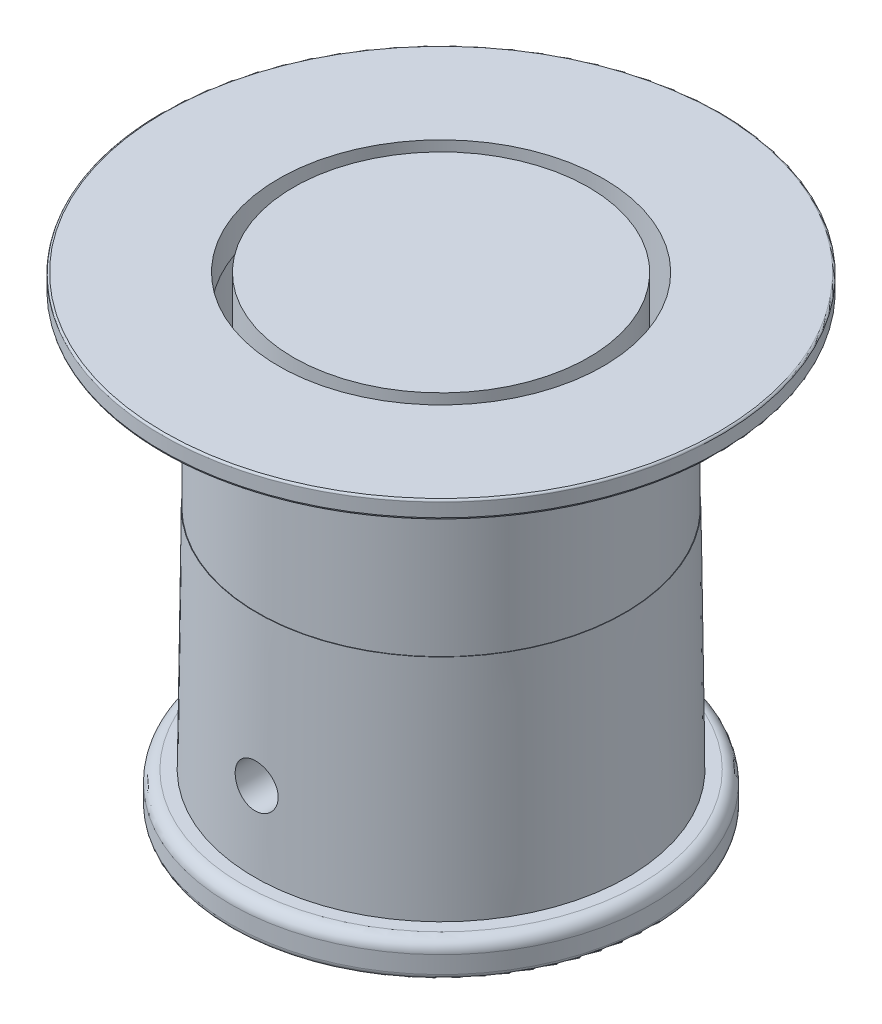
ISO-10303-21;
HEADER;
FILE_DESCRIPTION(('STEP AP214'),'2;1');
FILE_NAME('part.step','',(''),(''),'','','');
FILE_SCHEMA(('AUTOMOTIVE_DESIGN { 1 0 10303 214 1 1 1 1 }'));
ENDSEC;
DATA;
#1=APPLICATION_CONTEXT('core data for automotive mechanical design processes');
#2=APPLICATION_PROTOCOL_DEFINITION('international standard','automotive_design',2000,#1);
#3=PRODUCT_CONTEXT('',#1,'mechanical');
#4=PRODUCT('Part','Part','',(#3));
#5=PRODUCT_RELATED_PRODUCT_CATEGORY('part','',(#4));
#6=PRODUCT_DEFINITION_FORMATION('','',#4);
#7=PRODUCT_DEFINITION_CONTEXT('part definition',#1,'design');
#8=PRODUCT_DEFINITION('design','',#6,#7);
#9=PRODUCT_DEFINITION_SHAPE('','',#8);
#10=(LENGTH_UNIT() NAMED_UNIT(*) SI_UNIT(.MILLI.,.METRE.));
#11=(NAMED_UNIT(*) PLANE_ANGLE_UNIT() SI_UNIT($,.RADIAN.));
#12=(NAMED_UNIT(*) SI_UNIT($,.STERADIAN.) SOLID_ANGLE_UNIT());
#13=UNCERTAINTY_MEASURE_WITH_UNIT(LENGTH_MEASURE(1.E-05),#10,'distance_accuracy_value','');
#14=(GEOMETRIC_REPRESENTATION_CONTEXT(3) GLOBAL_UNCERTAINTY_ASSIGNED_CONTEXT((#13)) GLOBAL_UNIT_ASSIGNED_CONTEXT((#10,
#11,#12)) REPRESENTATION_CONTEXT('',''));
#15=CARTESIAN_POINT('',(0.,0.,0.));
#16=DIRECTION('',(0.,0.,1.));
#17=DIRECTION('',(1.,0.,0.));
#18=AXIS2_PLACEMENT_3D('',#15,#16,#17);
#19=CARTESIAN_POINT('',(0.,44.0944,0.));
#20=DIRECTION('',(0.,1.,0.));
#21=DIRECTION('',(0.,0.,1.));
#22=AXIS2_PLACEMENT_3D('',#19,#20,#21);
#23=CYLINDRICAL_SURFACE('',#22,20.0363150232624);
#24=CARTESIAN_POINT('',(0.,44.0944,0.));
#25=DIRECTION('',(0.,1.,0.));
#26=DIRECTION('',(0.,0.,1.));
#27=AXIS2_PLACEMENT_3D('',#24,#25,#26);
#28=CIRCLE('',#27,20.0363150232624);
#29=CARTESIAN_POINT('',(0.,44.0944,20.0363150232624));
#30=VERTEX_POINT('',#29);
#31=EDGE_CURVE('E11',#30,#30,#28,.T.);
#32=CARTESIAN_POINT('',(0.,63.1444,0.));
#33=DIRECTION('',(0.,1.,0.));
#34=DIRECTION('',(0.,0.,1.));
#35=AXIS2_PLACEMENT_3D('',#32,#33,#34);
#36=CIRCLE('',#35,20.0363150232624);
#37=CARTESIAN_POINT('',(0.,63.1444,20.0363150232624));
#38=VERTEX_POINT('',#37);
#39=EDGE_CURVE('E42',#38,#38,#36,.T.);
#40=CARTESIAN_POINT('',(0.,44.0944,20.0363150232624));
#41=CARTESIAN_POINT('',(0.,44.2928375,20.0363150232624));
#42=CARTESIAN_POINT('',(0.,44.491275,20.0363150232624));
#43=CARTESIAN_POINT('',(0.,44.88815,20.0363150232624));
#44=CARTESIAN_POINT('',(0.,45.0865875,20.0363150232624));
#45=CARTESIAN_POINT('',(0.,45.4834625,20.0363150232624));
#46=CARTESIAN_POINT('',(0.,45.6819,20.0363150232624));
#47=CARTESIAN_POINT('',(0.,46.078775,20.0363150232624));
#48=CARTESIAN_POINT('',(0.,46.2772125,20.0363150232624));
#49=CARTESIAN_POINT('',(0.,46.6740875,20.0363150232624));
#50=CARTESIAN_POINT('',(0.,46.872525,20.0363150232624));
#51=CARTESIAN_POINT('',(0.,47.2694,20.0363150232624));
#52=CARTESIAN_POINT('',(0.,47.4678375,20.0363150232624));
#53=CARTESIAN_POINT('',(0.,47.8647125,20.0363150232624));
#54=CARTESIAN_POINT('',(0.,48.06315,20.0363150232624));
#55=CARTESIAN_POINT('',(0.,48.460025,20.0363150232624));
#56=CARTESIAN_POINT('',(0.,48.6584625,20.0363150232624));
#57=CARTESIAN_POINT('',(0.,49.0553375,20.0363150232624));
#58=CARTESIAN_POINT('',(0.,49.253775,20.0363150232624));
#59=CARTESIAN_POINT('',(0.,49.65065,20.0363150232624));
#60=CARTESIAN_POINT('',(0.,49.8490875,20.0363150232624));
#61=CARTESIAN_POINT('',(0.,50.2459625,20.0363150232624));
#62=CARTESIAN_POINT('',(0.,50.4444,20.0363150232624));
#63=CARTESIAN_POINT('',(0.,50.841275,20.0363150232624));
#64=CARTESIAN_POINT('',(0.,51.0397125,20.0363150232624));
#65=CARTESIAN_POINT('',(0.,51.4365875,20.0363150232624));
#66=CARTESIAN_POINT('',(0.,51.635025,20.0363150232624));
#67=CARTESIAN_POINT('',(0.,52.0319,20.0363150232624));
#68=CARTESIAN_POINT('',(0.,52.2303375,20.0363150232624));
#69=CARTESIAN_POINT('',(0.,52.6272125,20.0363150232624));
#70=CARTESIAN_POINT('',(0.,52.82565,20.0363150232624));
#71=CARTESIAN_POINT('',(0.,53.222525,20.0363150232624));
#72=CARTESIAN_POINT('',(0.,53.4209625,20.0363150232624));
#73=CARTESIAN_POINT('',(0.,53.8178375,20.0363150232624));
#74=CARTESIAN_POINT('',(0.,54.016275,20.0363150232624));
#75=CARTESIAN_POINT('',(0.,54.41315,20.0363150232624));
#76=CARTESIAN_POINT('',(0.,54.6115875,20.0363150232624));
#77=CARTESIAN_POINT('',(0.,55.0084625,20.0363150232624));
#78=CARTESIAN_POINT('',(0.,55.2069,20.0363150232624));
#79=CARTESIAN_POINT('',(0.,55.603775,20.0363150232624));
#80=CARTESIAN_POINT('',(0.,55.8022125,20.0363150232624));
#81=CARTESIAN_POINT('',(0.,56.1990875,20.0363150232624));
#82=CARTESIAN_POINT('',(0.,56.397525,20.0363150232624));
#83=CARTESIAN_POINT('',(0.,56.7944,20.0363150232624));
#84=CARTESIAN_POINT('',(0.,56.9928375,20.0363150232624));
#85=CARTESIAN_POINT('',(0.,57.3897125,20.0363150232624));
#86=CARTESIAN_POINT('',(0.,57.58815,20.0363150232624));
#87=CARTESIAN_POINT('',(0.,57.985025,20.0363150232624));
#88=CARTESIAN_POINT('',(0.,58.1834625,20.0363150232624));
#89=CARTESIAN_POINT('',(0.,58.5803375,20.0363150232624));
#90=CARTESIAN_POINT('',(0.,58.778775,20.0363150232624));
#91=CARTESIAN_POINT('',(0.,59.17565,20.0363150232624));
#92=CARTESIAN_POINT('',(0.,59.3740875,20.0363150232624));
#93=CARTESIAN_POINT('',(0.,59.7709625,20.0363150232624));
#94=CARTESIAN_POINT('',(0.,59.9694,20.0363150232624));
#95=CARTESIAN_POINT('',(0.,60.366275,20.0363150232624));
#96=CARTESIAN_POINT('',(0.,60.5647125,20.0363150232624));
#97=CARTESIAN_POINT('',(0.,60.9615875,20.0363150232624));
#98=CARTESIAN_POINT('',(0.,61.160025,20.0363150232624));
#99=CARTESIAN_POINT('',(0.,61.5569,20.0363150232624));
#100=CARTESIAN_POINT('',(0.,61.7553375,20.0363150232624));
#101=CARTESIAN_POINT('',(0.,62.1522125,20.0363150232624));
#102=CARTESIAN_POINT('',(0.,62.35065,20.0363150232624));
#103=CARTESIAN_POINT('',(0.,62.747525,20.0363150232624));
#104=CARTESIAN_POINT('',(0.,62.9459625,20.0363150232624));
#105=CARTESIAN_POINT('',(0.,63.1444,20.0363150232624));
#106=B_SPLINE_CURVE_WITH_KNOTS('',3,(#40,#41,#42,#43,#44,#45,#46,#47,#48,#49,#50,#51,#52,#53,
#54,#55,#56,#57,#58,#59,#60,#61,#62,#63,#64,#65,#66,#67,#68,#69,#70,#71,#72,#73,#74,#75,#76,#77,
#78,#79,#80,#81,#82,#83,#84,#85,#86,#87,#88,#89,#90,#91,#92,#93,#94,#95,#96,#97,#98,#99,#100,
#101,#102,#103,#104,#105),.UNSPECIFIED.,.F.,.F.,(4,2,2,2,2,2,2,2,2,2,2,2,2,2,2,2,2,2,2,2,2,2,2,
2,2,2,2,2,2,2,2,2,4),(0.,0.595312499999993,1.19062499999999,1.78593749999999,2.38124999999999,
2.97656249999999,3.571875,4.1671875,4.7625,5.3578125,5.953125,6.5484375,7.14375,7.7390625,
8.33437499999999,8.92968749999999,9.52499999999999,10.1203125,10.715625,11.3109375,11.90625,
12.5015625,13.096875,13.6921875,14.2875,14.8828125,15.478125,16.0734375,16.66875,17.2640625,
17.859375,18.4546875,19.05),.UNSPECIFIED.);
#107=EDGE_CURVE('BSEAM39',#30,#38,#106,.T.);
#108=ORIENTED_EDGE('',*,*,#31,.T.);
#109=ORIENTED_EDGE('',*,*,#39,.F.);
#110=ORIENTED_EDGE('',*,*,#107,.T.);
#111=ORIENTED_EDGE('',*,*,#107,.F.);
#112=EDGE_LOOP('',(#108,#110,#109,#111));
#113=FACE_BOUND('',#112,.T.);
#114=ADVANCED_FACE('F39',(#113),#23,.T.);
#115=CARTESIAN_POINT('',(0.,44.0944,0.));
#116=DIRECTION('',(0.,1.,0.));
#117=DIRECTION('',(0.,0.,1.));
#118=AXIS2_PLACEMENT_3D('',#115,#116,#117);
#119=PLANE('',#118);
#120=ORIENTED_EDGE('',*,*,#31,.F.);
#121=EDGE_LOOP('',(#120));
#122=FACE_BOUND('',#121,.T.);
#123=ADVANCED_FACE('F54',(#122),#119,.F.);
#124=CARTESIAN_POINT('',(0.,63.1444,0.));
#125=DIRECTION('',(0.,1.,0.));
#126=DIRECTION('',(0.,0.,1.));
#127=AXIS2_PLACEMENT_3D('',#124,#125,#126);
#128=PLANE('',#127);
#129=ORIENTED_EDGE('',*,*,#39,.T.);
#130=EDGE_LOOP('',(#129));
#131=FACE_BOUND('',#130,.T.);
#132=ADVANCED_FACE('F51',(#131),#128,.T.);
#133=CLOSED_SHELL('',(#114,#123,#132));
#134=MANIFOLD_SOLID_BREP('B2',#133);
#135=CARTESIAN_POINT('',(0.,15.367,0.));
#136=DIRECTION('',(0.,-1.,0.));
#137=DIRECTION('',(0.,0.,-1.));
#138=AXIS2_PLACEMENT_3D('',#135,#136,#137);
#139=CYLINDRICAL_SURFACE('',#138,22.0472);
#140=CARTESIAN_POINT('',(0.,63.1444,0.));
#141=DIRECTION('',(0.,-1.,0.));
#142=DIRECTION('',(0.,0.,-1.));
#143=AXIS2_PLACEMENT_3D('',#140,#141,#142);
#144=CIRCLE('',#143,22.0472);
#145=CARTESIAN_POINT('',(0.,63.1444,-22.0472));
#146=VERTEX_POINT('',#145);
#147=EDGE_CURVE('E95',#146,#146,#144,.T.);
#148=ORIENTED_EDGE('',*,*,#147,.F.);
#149=EDGE_LOOP('',(#148));
#150=FACE_BOUND('',#149,.T.);
#151=DIRECTION('',(0.,1.,0.));
#152=VECTOR('',#151,1.);
#153=CARTESIAN_POINT('',(-15.589724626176,3.23427995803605,-15.5897246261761));
#154=LINE('',#153,#152);
#155=CARTESIAN_POINT('',(-15.589724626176,45.72,-15.5897246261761));
#156=VERTEX_POINT('',#155);
#157=CARTESIAN_POINT('',(-15.589724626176,58.42,-15.5897246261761));
#158=VERTEX_POINT('',#157);
#159=EDGE_CURVE('E216',#156,#158,#154,.T.);
#160=ORIENTED_EDGE('',*,*,#159,.F.);
#161=CARTESIAN_POINT('',(0.,45.72,0.));
#162=DIRECTION('',(0.,1.,0.));
#163=DIRECTION('',(0.,0.,1.));
#164=AXIS2_PLACEMENT_3D('',#161,#162,#163);
#165=CIRCLE('',#164,22.0472);
#166=CARTESIAN_POINT('',(15.589724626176,45.72,-15.5897246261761));
#167=VERTEX_POINT('',#166);
#168=EDGE_CURVE('E217',#156,#167,#165,.F.);
#169=ORIENTED_EDGE('',*,*,#168,.T.);
#170=DIRECTION('',(0.,1.,0.));
#171=VECTOR('',#170,1.);
#172=CARTESIAN_POINT('',(15.589724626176,3.23427995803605,-15.5897246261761));
#173=LINE('',#172,#171);
#174=CARTESIAN_POINT('',(15.589724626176,58.42,-15.5897246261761));
#175=VERTEX_POINT('',#174);
#176=EDGE_CURVE('E186',#167,#175,#173,.T.);
#177=ORIENTED_EDGE('',*,*,#176,.T.);
#178=CARTESIAN_POINT('',(0.,58.42,0.));
#179=DIRECTION('',(0.,-1.,0.));
#180=DIRECTION('',(0.,0.,1.));
#181=AXIS2_PLACEMENT_3D('',#178,#179,#180);
#182=CIRCLE('',#181,22.0472);
#183=CARTESIAN_POINT('',(15.589724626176,58.42,15.5897246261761));
#184=VERTEX_POINT('',#183);
#185=EDGE_CURVE('E225',#175,#184,#182,.T.);
#186=ORIENTED_EDGE('',*,*,#185,.T.);
#187=DIRECTION('',(0.,1.,0.));
#188=VECTOR('',#187,1.);
#189=CARTESIAN_POINT('',(15.589724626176,3.23427995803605,15.5897246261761));
#190=LINE('',#189,#188);
#191=CARTESIAN_POINT('',(15.589724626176,45.72,15.5897246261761));
#192=VERTEX_POINT('',#191);
#193=EDGE_CURVE('E110',#192,#184,#190,.T.);
#194=ORIENTED_EDGE('',*,*,#193,.F.);
#195=CARTESIAN_POINT('',(-15.589724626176,45.72,15.5897246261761));
#196=VERTEX_POINT('',#195);
#197=EDGE_CURVE('E157',#192,#196,#165,.F.);
#198=ORIENTED_EDGE('',*,*,#197,.T.);
#199=DIRECTION('',(0.,1.,0.));
#200=VECTOR('',#199,1.);
#201=CARTESIAN_POINT('',(-15.589724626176,3.23427995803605,15.5897246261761));
#202=LINE('',#201,#200);
#203=CARTESIAN_POINT('',(-15.589724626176,58.42,15.5897246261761));
#204=VERTEX_POINT('',#203);
#205=EDGE_CURVE('E226',#196,#204,#202,.T.);
#206=ORIENTED_EDGE('',*,*,#205,.T.);
#207=CARTESIAN_POINT('',(0.,58.42,0.));
#208=DIRECTION('',(0.,-1.,0.));
#209=DIRECTION('',(0.,0.,-1.));
#210=AXIS2_PLACEMENT_3D('',#207,#208,#209);
#211=CIRCLE('',#210,22.0472);
#212=EDGE_CURVE('E220',#204,#158,#211,.T.);
#213=ORIENTED_EDGE('',*,*,#212,.T.);
#214=EDGE_LOOP('',(#160,#169,#177,#186,#194,#198,#206,#213));
#215=FACE_BOUND('',#214,.T.);
#216=ADVANCED_FACE('F88',(#150,#215),#139,.F.);
#217=CARTESIAN_POINT('',(-37.592,63.1444,0.));
#218=DIRECTION('',(0.,-1.,0.));
#219=DIRECTION('',(0.,0.,-1.));
#220=AXIS2_PLACEMENT_3D('',#217,#218,#219);
#221=PLANE('',#220);
#222=CARTESIAN_POINT('',(0.,63.1444,0.));
#223=DIRECTION('',(0.,-1.,0.));
#224=DIRECTION('',(0.,0.,-1.));
#225=AXIS2_PLACEMENT_3D('',#222,#223,#224);
#226=CIRCLE('',#225,37.592);
#227=CARTESIAN_POINT('',(0.,63.1444,-37.592));
#228=VERTEX_POINT('',#227);
#229=EDGE_CURVE('E204',#228,#228,#226,.T.);
#230=ORIENTED_EDGE('',*,*,#229,.F.);
#231=EDGE_LOOP('',(#230));
#232=FACE_BOUND('',#231,.T.);
#233=ORIENTED_EDGE('',*,*,#147,.T.);
#234=EDGE_LOOP('',(#233));
#235=FACE_BOUND('',#234,.T.);
#236=ADVANCED_FACE('F209',(#232,#235),#221,.F.);
#237=CARTESIAN_POINT('',(0.,62.8904,0.));
#238=DIRECTION('',(0.,-1.,0.));
#239=DIRECTION('',(0.,0.,-1.));
#240=AXIS2_PLACEMENT_3D('',#237,#238,#239);
#241=TOROIDAL_SURFACE('',#240,37.592,0.253999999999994);
#242=CARTESIAN_POINT('',(0.,62.8904,0.));
#243=DIRECTION('',(0.,-1.,0.));
#244=DIRECTION('',(0.,0.,-1.));
#245=AXIS2_PLACEMENT_3D('',#242,#243,#244);
#246=CIRCLE('',#245,37.846);
#247=CARTESIAN_POINT('',(0.,62.8904,-37.846));
#248=VERTEX_POINT('',#247);
#249=EDGE_CURVE('E201',#248,#248,#246,.T.);
#250=ORIENTED_EDGE('',*,*,#249,.F.);
#251=EDGE_LOOP('',(#250));
#252=FACE_BOUND('',#251,.T.);
#253=ORIENTED_EDGE('',*,*,#229,.T.);
#254=EDGE_LOOP('',(#253));
#255=FACE_BOUND('',#254,.T.);
#256=ADVANCED_FACE('F309',(#252,#255),#241,.T.);
#257=CARTESIAN_POINT('',(0.,15.367,0.));
#258=DIRECTION('',(0.,-1.,0.));
#259=DIRECTION('',(0.,0.,-1.));
#260=AXIS2_PLACEMENT_3D('',#257,#258,#259);
#261=CYLINDRICAL_SURFACE('',#260,37.846);
#262=CARTESIAN_POINT('',(0.,61.0489,0.));
#263=DIRECTION('',(0.,-1.,0.));
#264=DIRECTION('',(0.,0.,-1.));
#265=AXIS2_PLACEMENT_3D('',#262,#263,#264);
#266=CIRCLE('',#265,37.846);
#267=CARTESIAN_POINT('',(0.,61.0489,-37.846));
#268=VERTEX_POINT('',#267);
#269=EDGE_CURVE('E198',#268,#268,#266,.T.);
#270=ORIENTED_EDGE('',*,*,#269,.F.);
#271=EDGE_LOOP('',(#270));
#272=FACE_BOUND('',#271,.T.);
#273=ORIENTED_EDGE('',*,*,#249,.T.);
#274=EDGE_LOOP('',(#273));
#275=FACE_BOUND('',#274,.T.);
#276=ADVANCED_FACE('F305',(#272,#275),#261,.T.);
#277=CARTESIAN_POINT('',(0.,61.0489,0.));
#278=DIRECTION('',(0.,-1.,0.));
#279=DIRECTION('',(0.,0.,-1.));
#280=AXIS2_PLACEMENT_3D('',#277,#278,#279);
#281=TOROIDAL_SURFACE('',#280,37.592,0.254000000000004);
#282=CARTESIAN_POINT('',(0.,60.7949,0.));
#283=DIRECTION('',(0.,-1.,0.));
#284=DIRECTION('',(0.,0.,-1.));
#285=AXIS2_PLACEMENT_3D('',#282,#283,#284);
#286=CIRCLE('',#285,37.592);
#287=CARTESIAN_POINT('',(0.,60.7949,-37.592));
#288=VERTEX_POINT('',#287);
#289=EDGE_CURVE('E195',#288,#288,#286,.T.);
#290=ORIENTED_EDGE('',*,*,#289,.F.);
#291=EDGE_LOOP('',(#290));
#292=FACE_BOUND('',#291,.T.);
#293=ORIENTED_EDGE('',*,*,#269,.T.);
#294=EDGE_LOOP('',(#293));
#295=FACE_BOUND('',#294,.T.);
#296=ADVANCED_FACE('F301',(#292,#295),#281,.T.);
#297=CARTESIAN_POINT('',(-25.288875,60.7949,0.));
#298=DIRECTION('',(0.,1.,0.));
#299=DIRECTION('',(0.,0.,1.));
#300=AXIS2_PLACEMENT_3D('',#297,#298,#299);
#301=PLANE('',#300);
#302=CARTESIAN_POINT('',(0.,60.7949,0.));
#303=DIRECTION('',(0.,-1.,0.));
#304=DIRECTION('',(0.,0.,-1.));
#305=AXIS2_PLACEMENT_3D('',#302,#303,#304);
#306=CIRCLE('',#305,25.288875);
#307=CARTESIAN_POINT('',(0.,60.7949,-25.288875));
#308=VERTEX_POINT('',#307);
#309=EDGE_CURVE('E192',#308,#308,#306,.T.);
#310=ORIENTED_EDGE('',*,*,#309,.F.);
#311=EDGE_LOOP('',(#310));
#312=FACE_BOUND('',#311,.T.);
#313=ORIENTED_EDGE('',*,*,#289,.T.);
#314=EDGE_LOOP('',(#313));
#315=FACE_BOUND('',#314,.T.);
#316=ADVANCED_FACE('F297',(#312,#315),#301,.F.);
#317=CARTESIAN_POINT('',(0.,60.398025,0.));
#318=DIRECTION('',(0.,-1.,0.));
#319=DIRECTION('',(0.,0.,-1.));
#320=AXIS2_PLACEMENT_3D('',#317,#318,#319);
#321=TOROIDAL_SURFACE('',#320,25.288875,0.396875);
#322=CARTESIAN_POINT('',(0.,60.398025,0.));
#323=DIRECTION('',(0.,-1.,0.));
#324=DIRECTION('',(0.,0.,-1.));
#325=AXIS2_PLACEMENT_3D('',#322,#323,#324);
#326=CIRCLE('',#325,24.892);
#327=CARTESIAN_POINT('',(0.,60.398025,-24.892));
#328=VERTEX_POINT('',#327);
#329=EDGE_CURVE('E189',#328,#328,#326,.T.);
#330=ORIENTED_EDGE('',*,*,#329,.F.);
#331=EDGE_LOOP('',(#330));
#332=FACE_BOUND('',#331,.T.);
#333=ORIENTED_EDGE('',*,*,#309,.T.);
#334=EDGE_LOOP('',(#333));
#335=FACE_BOUND('',#334,.T.);
#336=ADVANCED_FACE('F293',(#332,#335),#321,.F.);
#337=CARTESIAN_POINT('',(0.,15.367,0.));
#338=DIRECTION('',(0.,-1.,0.));
#339=DIRECTION('',(0.,0.,-1.));
#340=AXIS2_PLACEMENT_3D('',#337,#338,#339);
#341=CYLINDRICAL_SURFACE('',#340,24.892);
#342=CARTESIAN_POINT('',(0.,35.56,0.));
#343=DIRECTION('',(0.,-1.,0.));
#344=DIRECTION('',(0.,0.,-1.));
#345=AXIS2_PLACEMENT_3D('',#342,#343,#344);
#346=CIRCLE('',#345,24.892);
#347=CARTESIAN_POINT('',(0.,35.56,-24.892));
#348=VERTEX_POINT('',#347);
#349=EDGE_CURVE('E185',#348,#348,#346,.T.);
#350=ORIENTED_EDGE('',*,*,#349,.F.);
#351=EDGE_LOOP('',(#350));
#352=FACE_BOUND('',#351,.T.);
#353=ORIENTED_EDGE('',*,*,#329,.T.);
#354=EDGE_LOOP('',(#353));
#355=FACE_BOUND('',#354,.T.);
#356=ADVANCED_FACE('F289',(#352,#355),#341,.T.);
#357=CARTESIAN_POINT('',(-22.0472,35.56,0.));
#358=DIRECTION('',(0.,1.,0.));
#359=DIRECTION('',(0.,0.,1.));
#360=AXIS2_PLACEMENT_3D('',#357,#358,#359);
#361=PLANE('',#360);
#362=CARTESIAN_POINT('',(0.,35.56,0.));
#363=DIRECTION('',(0.,-1.,0.));
#364=DIRECTION('',(0.,0.,-1.));
#365=AXIS2_PLACEMENT_3D('',#362,#363,#364);
#366=CIRCLE('',#365,22.352);
#367=CARTESIAN_POINT('',(0.,35.56,-22.352));
#368=VERTEX_POINT('',#367);
#369=EDGE_CURVE('E172',#368,#368,#366,.F.);
#370=ORIENTED_EDGE('',*,*,#369,.T.);
#371=EDGE_LOOP('',(#370));
#372=FACE_BOUND('',#371,.T.);
#373=ORIENTED_EDGE('',*,*,#349,.T.);
#374=EDGE_LOOP('',(#373));
#375=FACE_BOUND('',#374,.T.);
#376=ADVANCED_FACE('F282',(#372,#375),#361,.F.);
#377=CARTESIAN_POINT('',(0.,58.42,0.));
#378=DIRECTION('',(0.,1.,0.));
#379=DIRECTION('',(0.,0.,1.));
#380=AXIS2_PLACEMENT_3D('',#377,#378,#379);
#381=PLANE('',#380);
#382=ORIENTED_EDGE('',*,*,#185,.F.);
#383=DIRECTION('',(-0.707106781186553,0.,0.707106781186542));
#384=VECTOR('',#383,1.);
#385=CARTESIAN_POINT('',(15.589724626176,58.42,-15.5897246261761));
#386=LINE('',#385,#384);
#387=CARTESIAN_POINT('',(15.8052507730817,58.42,-15.8052507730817));
#388=VERTEX_POINT('',#387);
#389=EDGE_CURVE('E173',#388,#175,#386,.T.);
#390=ORIENTED_EDGE('',*,*,#389,.F.);
#391=CARTESIAN_POINT('',(0.,58.42,0.));
#392=DIRECTION('',(0.,1.,0.));
#393=DIRECTION('',(0.,0.,1.));
#394=AXIS2_PLACEMENT_3D('',#391,#392,#393);
#395=CIRCLE('',#394,22.352);
#396=CARTESIAN_POINT('',(15.8052507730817,58.42,15.8052507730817));
#397=VERTEX_POINT('',#396);
#398=EDGE_CURVE('E179',#397,#388,#395,.T.);
#399=ORIENTED_EDGE('',*,*,#398,.F.);
#400=DIRECTION('',(0.707106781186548,0.,0.707106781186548));
#401=VECTOR('',#400,1.);
#402=CARTESIAN_POINT('',(15.589724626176,58.42,15.5897246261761));
#403=LINE('',#402,#401);
#404=EDGE_CURVE('E171',#184,#397,#403,.T.);
#405=ORIENTED_EDGE('',*,*,#404,.F.);
#406=EDGE_LOOP('',(#382,#390,#399,#405));
#407=FACE_BOUND('',#406,.T.);
#408=ADVANCED_FACE('F243',(#407),#381,.F.);
#409=CARTESIAN_POINT('',(15.589724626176,3.23427995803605,15.5897246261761));
#410=DIRECTION('',(-0.707106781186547,0.,0.707106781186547));
#411=DIRECTION('',(0.707106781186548,0.,0.707106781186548));
#412=AXIS2_PLACEMENT_3D('',#409,#410,#411);
#413=PLANE('',#412);
#414=DIRECTION('',(0.,1.,0.));
#415=VECTOR('',#414,1.);
#416=CARTESIAN_POINT('',(15.8052507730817,3.23427995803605,15.8052507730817));
#417=LINE('',#416,#415);
#418=CARTESIAN_POINT('',(15.8052507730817,45.72,15.8052507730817));
#419=VERTEX_POINT('',#418);
#420=EDGE_CURVE('E165',#419,#397,#417,.T.);
#421=ORIENTED_EDGE('',*,*,#420,.F.);
#422=DIRECTION('',(-0.707106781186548,0.,-0.707106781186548));
#423=VECTOR('',#422,1.);
#424=CARTESIAN_POINT('',(15.589724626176,45.72,15.5897246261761));
#425=LINE('',#424,#423);
#426=EDGE_CURVE('E152',#419,#192,#425,.T.);
#427=ORIENTED_EDGE('',*,*,#426,.T.);
#428=ORIENTED_EDGE('',*,*,#193,.T.);
#429=ORIENTED_EDGE('',*,*,#404,.T.);
#430=EDGE_LOOP('',(#421,#427,#428,#429));
#431=FACE_BOUND('',#430,.T.);
#432=ADVANCED_FACE('F170',(#431),#413,.F.);
#433=CARTESIAN_POINT('',(0.,3.23427995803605,0.));
#434=DIRECTION('',(0.,1.,0.));
#435=DIRECTION('',(0.,0.,1.));
#436=AXIS2_PLACEMENT_3D('',#433,#434,#435);
#437=CYLINDRICAL_SURFACE('',#436,22.352);
#438=CARTESIAN_POINT('',(0.,45.72,0.));
#439=DIRECTION('',(0.,1.,0.));
#440=DIRECTION('',(0.,0.,1.));
#441=AXIS2_PLACEMENT_3D('',#438,#439,#440);
#442=CIRCLE('',#441,22.352);
#443=CARTESIAN_POINT('',(-15.8052507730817,45.72,15.8052507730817));
#444=VERTEX_POINT('',#443);
#445=EDGE_CURVE('E155',#444,#419,#442,.T.);
#446=ORIENTED_EDGE('',*,*,#445,.T.);
#447=ORIENTED_EDGE('',*,*,#420,.T.);
#448=ORIENTED_EDGE('',*,*,#398,.T.);
#449=DIRECTION('',(0.,1.,0.));
#450=VECTOR('',#449,1.);
#451=CARTESIAN_POINT('',(15.8052507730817,3.23427995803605,-15.8052507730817));
#452=LINE('',#451,#450);
#453=CARTESIAN_POINT('',(15.8052507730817,45.72,-15.8052507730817));
#454=VERTEX_POINT('',#453);
#455=EDGE_CURVE('E176',#454,#388,#452,.T.);
#456=ORIENTED_EDGE('',*,*,#455,.F.);
#457=CARTESIAN_POINT('',(-15.8052507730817,45.72,-15.8052507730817));
#458=VERTEX_POINT('',#457);
#459=EDGE_CURVE('E102',#454,#458,#442,.T.);
#460=ORIENTED_EDGE('',*,*,#459,.T.);
#461=DIRECTION('',(0.,1.,0.));
#462=VECTOR('',#461,1.);
#463=CARTESIAN_POINT('',(-15.8052507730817,3.23427995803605,-15.8052507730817));
#464=LINE('',#463,#462);
#465=CARTESIAN_POINT('',(-15.8052507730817,58.42,-15.8052507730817));
#466=VERTEX_POINT('',#465);
#467=EDGE_CURVE('E232',#458,#466,#464,.T.);
#468=ORIENTED_EDGE('',*,*,#467,.T.);
#469=CARTESIAN_POINT('',(0.,58.42,0.));
#470=DIRECTION('',(0.,1.,0.));
#471=DIRECTION('',(0.,0.,-1.));
#472=AXIS2_PLACEMENT_3D('',#469,#470,#471);
#473=CIRCLE('',#472,22.352);
#474=CARTESIAN_POINT('',(-15.8052507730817,58.42,15.8052507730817));
#475=VERTEX_POINT('',#474);
#476=EDGE_CURVE('E253',#466,#475,#473,.T.);
#477=ORIENTED_EDGE('',*,*,#476,.T.);
#478=DIRECTION('',(0.,1.,0.));
#479=VECTOR('',#478,1.);
#480=CARTESIAN_POINT('',(-15.8052507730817,3.23427995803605,15.8052507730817));
#481=LINE('',#480,#479);
#482=EDGE_CURVE('E168',#444,#475,#481,.T.);
#483=ORIENTED_EDGE('',*,*,#482,.F.);
#484=EDGE_LOOP('',(#446,#447,#448,#456,#460,#468,#477,#483));
#485=FACE_BOUND('',#484,.T.);
#486=ORIENTED_EDGE('',*,*,#369,.F.);
#487=EDGE_LOOP('',(#486));
#488=FACE_BOUND('',#487,.T.);
#489=ADVANCED_FACE('F162',(#485,#488),#437,.F.);
#490=CARTESIAN_POINT('',(15.589724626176,3.23427995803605,-15.5897246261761));
#491=DIRECTION('',(-0.707106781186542,0.,-0.707106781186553));
#492=DIRECTION('',(-0.707106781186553,0.,0.707106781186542));
#493=AXIS2_PLACEMENT_3D('',#490,#491,#492);
#494=PLANE('',#493);
#495=ORIENTED_EDGE('',*,*,#176,.F.);
#496=DIRECTION('',(0.707106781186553,0.,-0.707106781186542));
#497=VECTOR('',#496,1.);
#498=CARTESIAN_POINT('',(15.589724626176,45.72,-15.5897246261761));
#499=LINE('',#498,#497);
#500=EDGE_CURVE('E241',#167,#454,#499,.T.);
#501=ORIENTED_EDGE('',*,*,#500,.T.);
#502=ORIENTED_EDGE('',*,*,#455,.T.);
#503=ORIENTED_EDGE('',*,*,#389,.T.);
#504=EDGE_LOOP('',(#495,#501,#502,#503));
#505=FACE_BOUND('',#504,.T.);
#506=ADVANCED_FACE('F239',(#505),#494,.F.);
#507=CARTESIAN_POINT('',(0.,58.42,0.));
#508=DIRECTION('',(0.,-1.,0.));
#509=DIRECTION('',(0.,0.,-1.));
#510=AXIS2_PLACEMENT_3D('',#507,#508,#509);
#511=PLANE('',#510);
#512=ORIENTED_EDGE('',*,*,#212,.F.);
#513=DIRECTION('',(0.707106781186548,0.,-0.707106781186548));
#514=VECTOR('',#513,1.);
#515=CARTESIAN_POINT('',(-15.589724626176,58.42,15.5897246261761));
#516=LINE('',#515,#514);
#517=EDGE_CURVE('E250',#475,#204,#516,.T.);
#518=ORIENTED_EDGE('',*,*,#517,.F.);
#519=ORIENTED_EDGE('',*,*,#476,.F.);
#520=DIRECTION('',(-0.707106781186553,0.,-0.707106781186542));
#521=VECTOR('',#520,1.);
#522=CARTESIAN_POINT('',(-15.589724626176,58.42,-15.5897246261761));
#523=LINE('',#522,#521);
#524=EDGE_CURVE('E255',#158,#466,#523,.T.);
#525=ORIENTED_EDGE('',*,*,#524,.F.);
#526=EDGE_LOOP('',(#512,#518,#519,#525));
#527=FACE_BOUND('',#526,.T.);
#528=ADVANCED_FACE('F271',(#527),#511,.T.);
#529=CARTESIAN_POINT('',(-15.589724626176,3.23427995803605,-15.5897246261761));
#530=DIRECTION('',(0.707106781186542,0.,-0.707106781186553));
#531=DIRECTION('',(-0.707106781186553,0.,-0.707106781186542));
#532=AXIS2_PLACEMENT_3D('',#529,#530,#531);
#533=PLANE('',#532);
#534=ORIENTED_EDGE('',*,*,#467,.F.);
#535=DIRECTION('',(0.707106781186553,0.,0.707106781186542));
#536=VECTOR('',#535,1.);
#537=CARTESIAN_POINT('',(-15.589724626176,45.72,-15.5897246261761));
#538=LINE('',#537,#536);
#539=EDGE_CURVE('E159',#458,#156,#538,.T.);
#540=ORIENTED_EDGE('',*,*,#539,.T.);
#541=ORIENTED_EDGE('',*,*,#159,.T.);
#542=ORIENTED_EDGE('',*,*,#524,.T.);
#543=EDGE_LOOP('',(#534,#540,#541,#542));
#544=FACE_BOUND('',#543,.T.);
#545=ADVANCED_FACE('F262',(#544),#533,.F.);
#546=CARTESIAN_POINT('',(-15.589724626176,3.23427995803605,15.5897246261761));
#547=DIRECTION('',(0.707106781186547,0.,0.707106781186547));
#548=DIRECTION('',(0.707106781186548,0.,-0.707106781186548));
#549=AXIS2_PLACEMENT_3D('',#546,#547,#548);
#550=PLANE('',#549);
#551=ORIENTED_EDGE('',*,*,#205,.F.);
#552=DIRECTION('',(-0.707106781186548,0.,0.707106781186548));
#553=VECTOR('',#552,1.);
#554=CARTESIAN_POINT('',(-15.589724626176,45.72,15.5897246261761));
#555=LINE('',#554,#553);
#556=EDGE_CURVE('E37',#196,#444,#555,.T.);
#557=ORIENTED_EDGE('',*,*,#556,.T.);
#558=ORIENTED_EDGE('',*,*,#482,.T.);
#559=ORIENTED_EDGE('',*,*,#517,.T.);
#560=EDGE_LOOP('',(#551,#557,#558,#559));
#561=FACE_BOUND('',#560,.T.);
#562=ADVANCED_FACE('F248',(#561),#550,.F.);
#563=CARTESIAN_POINT('',(0.,45.72,0.));
#564=DIRECTION('',(0.,1.,0.));
#565=DIRECTION('',(0.,0.,1.));
#566=AXIS2_PLACEMENT_3D('',#563,#564,#565);
#567=PLANE('',#566);
#568=ORIENTED_EDGE('',*,*,#445,.F.);
#569=ORIENTED_EDGE('',*,*,#556,.F.);
#570=ORIENTED_EDGE('',*,*,#197,.F.);
#571=ORIENTED_EDGE('',*,*,#426,.F.);
#572=EDGE_LOOP('',(#568,#569,#570,#571));
#573=FACE_BOUND('',#572,.T.);
#574=ADVANCED_FACE('F154',(#573),#567,.F.);
#575=ORIENTED_EDGE('',*,*,#168,.F.);
#576=ORIENTED_EDGE('',*,*,#539,.F.);
#577=ORIENTED_EDGE('',*,*,#459,.F.);
#578=ORIENTED_EDGE('',*,*,#500,.F.);
#579=EDGE_LOOP('',(#575,#576,#577,#578));
#580=FACE_BOUND('',#579,.T.);
#581=ADVANCED_FACE('F264',(#580),#567,.F.);
#582=CLOSED_SHELL('',(#216,#236,#256,#276,#296,#316,#336,#356,#376,#408,#432,#489,#506,#528,
#545,#562,#574,#581));
#583=MANIFOLD_SOLID_BREP('B6',#582);
#584=CARTESIAN_POINT('',(0.,4.69899999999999,0.));
#585=DIRECTION('',(0.,1.,0.));
#586=DIRECTION('',(0.,0.,1.));
#587=AXIS2_PLACEMENT_3D('',#584,#585,#586);
#588=PLANE('',#587);
#589=CARTESIAN_POINT('',(0.,4.69899999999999,0.));
#590=DIRECTION('',(0.,1.,0.));
#591=DIRECTION('',(0.,0.,1.));
#592=AXIS2_PLACEMENT_3D('',#589,#590,#591);
#593=CIRCLE('',#592,22.6309438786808);
#594=CARTESIAN_POINT('',(-22.5795714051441,4.69899999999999,1.52399999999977));
#595=VERTEX_POINT('',#594);
#596=CARTESIAN_POINT('',(-4.1148,4.69899999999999,22.2537197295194));
#597=VERTEX_POINT('',#596);
#598=EDGE_CURVE('E775',#595,#597,#593,.T.);
#599=ORIENTED_EDGE('',*,*,#598,.F.);
#600=DIRECTION('',(-1.,0.,0.));
#601=VECTOR('',#600,1.);
#602=CARTESIAN_POINT('',(-22.6309438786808,4.69899999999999,1.52399999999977));
#603=LINE('',#602,#601);
#604=CARTESIAN_POINT('',(-22.6309438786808,4.69899999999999,1.52399999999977));
#605=VERTEX_POINT('',#604);
#606=EDGE_CURVE('E1014',#595,#605,#603,.T.);
#607=ORIENTED_EDGE('',*,*,#606,.T.);
#608=CARTESIAN_POINT('',(0.,4.69899999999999,0.));
#609=DIRECTION('',(0.,1.,0.));
#610=DIRECTION('',(0.,0.,1.));
#611=AXIS2_PLACEMENT_3D('',#608,#609,#610);
#612=CIRCLE('',#611,22.6822);
#613=CARTESIAN_POINT('',(-4.11480000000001,4.69899999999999,22.3058426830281));
#614=VERTEX_POINT('',#613);
#615=EDGE_CURVE('E889',#605,#614,#612,.T.);
#616=ORIENTED_EDGE('',*,*,#615,.T.);
#617=DIRECTION('',(0.,0.,1.));
#618=VECTOR('',#617,1.);
#619=CARTESIAN_POINT('',(-4.1148,4.69899999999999,2.60188876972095));
#620=LINE('',#619,#618);
#621=EDGE_CURVE('E1236',#597,#614,#620,.T.);
#622=ORIENTED_EDGE('',*,*,#621,.F.);
#623=EDGE_LOOP('',(#599,#607,#616,#622));
#624=FACE_BOUND('',#623,.T.);
#625=ADVANCED_FACE('F444',(#624),#588,.T.);
#626=CARTESIAN_POINT('',(4.1148,4.69899999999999,22.2537197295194));
#627=VERTEX_POINT('',#626);
#628=CARTESIAN_POINT('',(22.5795714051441,4.69899999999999,1.52400000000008));
#629=VERTEX_POINT('',#628);
#630=EDGE_CURVE('E1071',#627,#629,#593,.T.);
#631=ORIENTED_EDGE('',*,*,#630,.F.);
#632=DIRECTION('',(0.,0.,-1.));
#633=VECTOR('',#632,1.);
#634=CARTESIAN_POINT('',(4.1148,4.69899999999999,2.60188876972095));
#635=LINE('',#634,#633);
#636=CARTESIAN_POINT('',(4.1148,4.69899999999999,22.3058426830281));
#637=VERTEX_POINT('',#636);
#638=EDGE_CURVE('E943',#637,#627,#635,.T.);
#639=ORIENTED_EDGE('',*,*,#638,.F.);
#640=CARTESIAN_POINT('',(22.6309438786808,4.69899999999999,1.52400000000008));
#641=VERTEX_POINT('',#640);
#642=EDGE_CURVE('E890',#637,#641,#612,.T.);
#643=ORIENTED_EDGE('',*,*,#642,.T.);
#644=DIRECTION('',(-1.,0.,0.));
#645=VECTOR('',#644,1.);
#646=CARTESIAN_POINT('',(22.6309438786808,4.69899999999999,1.52400000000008));
#647=LINE('',#646,#645);
#648=EDGE_CURVE('E820',#641,#629,#647,.T.);
#649=ORIENTED_EDGE('',*,*,#648,.T.);
#650=EDGE_LOOP('',(#631,#639,#643,#649));
#651=FACE_BOUND('',#650,.T.);
#652=ADVANCED_FACE('F1227',(#651),#588,.T.);
#653=CARTESIAN_POINT('',(-1.524,4.69899999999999,-22.5795714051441));
#654=VERTEX_POINT('',#653);
#655=CARTESIAN_POINT('',(-22.5795714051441,4.69899999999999,-1.52400000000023));
#656=VERTEX_POINT('',#655);
#657=EDGE_CURVE('E1072',#654,#656,#593,.T.);
#658=ORIENTED_EDGE('',*,*,#657,.F.);
#659=DIRECTION('',(0.,0.,-1.));
#660=VECTOR('',#659,1.);
#661=CARTESIAN_POINT('',(-1.524,4.69899999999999,-22.6309438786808));
#662=LINE('',#661,#660);
#663=CARTESIAN_POINT('',(-1.524,4.69899999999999,-22.6309438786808));
#664=VERTEX_POINT('',#663);
#665=EDGE_CURVE('E849',#654,#664,#662,.T.);
#666=ORIENTED_EDGE('',*,*,#665,.T.);
#667=CARTESIAN_POINT('',(-22.6309438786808,4.69899999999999,-1.52400000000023));
#668=VERTEX_POINT('',#667);
#669=EDGE_CURVE('E885',#664,#668,#612,.T.);
#670=ORIENTED_EDGE('',*,*,#669,.T.);
#671=DIRECTION('',(1.,0.,0.));
#672=VECTOR('',#671,1.);
#673=CARTESIAN_POINT('',(-22.6309438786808,4.69899999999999,-1.52400000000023));
#674=LINE('',#673,#672);
#675=EDGE_CURVE('E1011',#668,#656,#674,.T.);
#676=ORIENTED_EDGE('',*,*,#675,.T.);
#677=EDGE_LOOP('',(#658,#666,#670,#676));
#678=FACE_BOUND('',#677,.T.);
#679=ADVANCED_FACE('F1232',(#678),#588,.T.);
#680=CARTESIAN_POINT('',(22.5795714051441,4.69899999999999,-1.52399999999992));
#681=VERTEX_POINT('',#680);
#682=CARTESIAN_POINT('',(1.524,4.69899999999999,-22.5795714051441));
#683=VERTEX_POINT('',#682);
#684=EDGE_CURVE('E1062',#681,#683,#593,.T.);
#685=ORIENTED_EDGE('',*,*,#684,.F.);
#686=DIRECTION('',(1.,0.,0.));
#687=VECTOR('',#686,1.);
#688=CARTESIAN_POINT('',(22.6309438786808,4.69899999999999,-1.52399999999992));
#689=LINE('',#688,#687);
#690=CARTESIAN_POINT('',(22.6309438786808,4.69899999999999,-1.52399999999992));
#691=VERTEX_POINT('',#690);
#692=EDGE_CURVE('E823',#681,#691,#689,.T.);
#693=ORIENTED_EDGE('',*,*,#692,.T.);
#694=CARTESIAN_POINT('',(1.524,4.69899999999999,-22.6309438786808));
#695=VERTEX_POINT('',#694);
#696=EDGE_CURVE('E891',#691,#695,#612,.T.);
#697=ORIENTED_EDGE('',*,*,#696,.T.);
#698=DIRECTION('',(0.,0.,1.));
#699=VECTOR('',#698,1.);
#700=CARTESIAN_POINT('',(1.524,4.69899999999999,-22.6309438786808));
#701=LINE('',#700,#699);
#702=EDGE_CURVE('E846',#695,#683,#701,.T.);
#703=ORIENTED_EDGE('',*,*,#702,.T.);
#704=EDGE_LOOP('',(#685,#693,#697,#703));
#705=FACE_BOUND('',#704,.T.);
#706=ADVANCED_FACE('F1061',(#705),#588,.T.);
#707=CARTESIAN_POINT('',(1.524,-6.8717416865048,-22.6309438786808));
#708=DIRECTION('',(1.,0.,0.));
#709=DIRECTION('',(0.,0.,-1.));
#710=AXIS2_PLACEMENT_3D('',#707,#708,#709);
#711=PLANE('',#710);
#712=DIRECTION('',(0.,1.,0.));
#713=VECTOR('',#712,1.);
#714=CARTESIAN_POINT('',(1.524,47.58949580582,-22.5795714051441));
#715=LINE('',#714,#713);
#716=CARTESIAN_POINT('',(1.524,35.56,-22.5795714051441));
#717=VERTEX_POINT('',#716);
#718=EDGE_CURVE('E1058',#683,#717,#715,.T.);
#719=ORIENTED_EDGE('',*,*,#718,.F.);
#720=ORIENTED_EDGE('',*,*,#702,.F.);
#721=DIRECTION('',(0.,1.,0.));
#722=VECTOR('',#721,1.);
#723=CARTESIAN_POINT('',(1.524,-6.8717416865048,-22.6309438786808));
#724=LINE('',#723,#722);
#725=CARTESIAN_POINT('',(1.524,35.56,-22.6309438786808));
#726=VERTEX_POINT('',#725);
#727=EDGE_CURVE('E859',#695,#726,#724,.T.);
#728=ORIENTED_EDGE('',*,*,#727,.T.);
#729=DIRECTION('',(0.,0.,-1.));
#730=VECTOR('',#729,1.);
#731=CARTESIAN_POINT('',(1.524,35.56,-22.6309438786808));
#732=LINE('',#731,#730);
#733=EDGE_CURVE('E854',#717,#726,#732,.T.);
#734=ORIENTED_EDGE('',*,*,#733,.F.);
#735=EDGE_LOOP('',(#719,#720,#728,#734));
#736=FACE_BOUND('',#735,.T.);
#737=ADVANCED_FACE('F1056',(#736),#711,.T.);
#738=CARTESIAN_POINT('',(-1.524,-6.8717416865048,-22.6309438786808));
#739=DIRECTION('',(-1.,0.,0.));
#740=DIRECTION('',(0.,0.,1.));
#741=AXIS2_PLACEMENT_3D('',#738,#739,#740);
#742=PLANE('',#741);
#743=DIRECTION('',(0.,1.,0.));
#744=VECTOR('',#743,1.);
#745=CARTESIAN_POINT('',(-1.524,47.58949580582,-22.5795714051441));
#746=LINE('',#745,#744);
#747=CARTESIAN_POINT('',(-1.524,35.56,-22.5795714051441));
#748=VERTEX_POINT('',#747);
#749=EDGE_CURVE('E1354',#748,#654,#746,.F.);
#750=ORIENTED_EDGE('',*,*,#749,.F.);
#751=DIRECTION('',(0.,0.,1.));
#752=VECTOR('',#751,1.);
#753=CARTESIAN_POINT('',(-1.524,35.56,-22.6309438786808));
#754=LINE('',#753,#752);
#755=CARTESIAN_POINT('',(-1.524,35.56,-22.6309438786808));
#756=VERTEX_POINT('',#755);
#757=EDGE_CURVE('E851',#756,#748,#754,.T.);
#758=ORIENTED_EDGE('',*,*,#757,.F.);
#759=DIRECTION('',(0.,1.,0.));
#760=VECTOR('',#759,1.);
#761=CARTESIAN_POINT('',(-1.524,-6.8717416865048,-22.6309438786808));
#762=LINE('',#761,#760);
#763=EDGE_CURVE('E858',#664,#756,#762,.T.);
#764=ORIENTED_EDGE('',*,*,#763,.F.);
#765=ORIENTED_EDGE('',*,*,#665,.F.);
#766=EDGE_LOOP('',(#750,#758,#764,#765));
#767=FACE_BOUND('',#766,.T.);
#768=ADVANCED_FACE('F1180',(#767),#742,.T.);
#769=CARTESIAN_POINT('',(22.6309438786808,-6.8717416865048,1.52400000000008));
#770=DIRECTION('',(0.,0.,1.));
#771=DIRECTION('',(1.,0.,0.));
#772=AXIS2_PLACEMENT_3D('',#769,#770,#771);
#773=PLANE('',#772);
#774=DIRECTION('',(0.,1.,0.));
#775=VECTOR('',#774,1.);
#776=CARTESIAN_POINT('',(22.5795714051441,47.58949580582,1.52400000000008));
#777=LINE('',#776,#775);
#778=CARTESIAN_POINT('',(22.5795714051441,35.56,1.52400000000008));
#779=VERTEX_POINT('',#778);
#780=EDGE_CURVE('E774',#629,#779,#777,.T.);
#781=ORIENTED_EDGE('',*,*,#780,.F.);
#782=ORIENTED_EDGE('',*,*,#648,.F.);
#783=DIRECTION('',(0.,1.,0.));
#784=VECTOR('',#783,1.);
#785=CARTESIAN_POINT('',(22.6309438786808,-6.8717416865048,1.52400000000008));
#786=LINE('',#785,#784);
#787=CARTESIAN_POINT('',(22.6309438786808,35.56,1.52400000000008));
#788=VERTEX_POINT('',#787);
#789=EDGE_CURVE('E832',#641,#788,#786,.T.);
#790=ORIENTED_EDGE('',*,*,#789,.T.);
#791=DIRECTION('',(1.,0.,0.));
#792=VECTOR('',#791,1.);
#793=CARTESIAN_POINT('',(22.6309438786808,35.56,1.52400000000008));
#794=LINE('',#793,#792);
#795=EDGE_CURVE('E827',#779,#788,#794,.T.);
#796=ORIENTED_EDGE('',*,*,#795,.F.);
#797=EDGE_LOOP('',(#781,#782,#790,#796));
#798=FACE_BOUND('',#797,.T.);
#799=ADVANCED_FACE('F1166',(#798),#773,.T.);
#800=CARTESIAN_POINT('',(22.6309438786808,-6.8717416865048,-1.52399999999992));
#801=DIRECTION('',(0.,0.,-1.));
#802=DIRECTION('',(-1.,0.,0.));
#803=AXIS2_PLACEMENT_3D('',#800,#801,#802);
#804=PLANE('',#803);
#805=DIRECTION('',(0.,1.,0.));
#806=VECTOR('',#805,1.);
#807=CARTESIAN_POINT('',(22.5795714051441,47.58949580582,-1.52399999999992));
#808=LINE('',#807,#806);
#809=CARTESIAN_POINT('',(22.5795714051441,35.56,-1.52399999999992));
#810=VERTEX_POINT('',#809);
#811=EDGE_CURVE('E1070',#810,#681,#808,.F.);
#812=ORIENTED_EDGE('',*,*,#811,.F.);
#813=DIRECTION('',(-1.,0.,0.));
#814=VECTOR('',#813,1.);
#815=CARTESIAN_POINT('',(22.6309438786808,35.56,-1.52399999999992));
#816=LINE('',#815,#814);
#817=CARTESIAN_POINT('',(22.6309438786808,35.56,-1.52399999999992));
#818=VERTEX_POINT('',#817);
#819=EDGE_CURVE('E825',#818,#810,#816,.T.);
#820=ORIENTED_EDGE('',*,*,#819,.F.);
#821=DIRECTION('',(0.,1.,0.));
#822=VECTOR('',#821,1.);
#823=CARTESIAN_POINT('',(22.6309438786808,-6.8717416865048,-1.52399999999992));
#824=LINE('',#823,#822);
#825=EDGE_CURVE('E831',#691,#818,#824,.T.);
#826=ORIENTED_EDGE('',*,*,#825,.F.);
#827=ORIENTED_EDGE('',*,*,#692,.F.);
#828=EDGE_LOOP('',(#812,#820,#826,#827));
#829=FACE_BOUND('',#828,.T.);
#830=ADVANCED_FACE('F1172',(#829),#804,.T.);
#831=CARTESIAN_POINT('',(-1.52400000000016,-6.8717416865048,22.6309438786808));
#832=DIRECTION('',(-1.,0.,0.));
#833=DIRECTION('',(0.,0.,1.));
#834=AXIS2_PLACEMENT_3D('',#831,#832,#833);
#835=PLANE('',#834);
#836=DIRECTION('',(0.,1.,0.));
#837=VECTOR('',#836,1.);
#838=CARTESIAN_POINT('',(-1.52400000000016,47.58949580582,22.5795714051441));
#839=LINE('',#838,#837);
#840=CARTESIAN_POINT('',(-1.52400000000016,19.4818,22.5795714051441));
#841=VERTEX_POINT('',#840);
#842=CARTESIAN_POINT('',(-1.52400000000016,35.56,22.5795714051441));
#843=VERTEX_POINT('',#842);
#844=EDGE_CURVE('E1366',#841,#843,#839,.T.);
#845=ORIENTED_EDGE('',*,*,#844,.F.);
#846=DIRECTION('',(0.,0.,-1.));
#847=VECTOR('',#846,1.);
#848=CARTESIAN_POINT('',(-1.52400000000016,19.4818,22.6309438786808));
#849=LINE('',#848,#847);
#850=CARTESIAN_POINT('',(-1.52400000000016,19.4818,22.6309438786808));
#851=VERTEX_POINT('',#850);
#852=EDGE_CURVE('E997',#851,#841,#849,.T.);
#853=ORIENTED_EDGE('',*,*,#852,.F.);
#854=DIRECTION('',(0.,1.,0.));
#855=VECTOR('',#854,1.);
#856=CARTESIAN_POINT('',(-1.52400000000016,-6.8717416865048,22.6309438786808));
#857=LINE('',#856,#855);
#858=CARTESIAN_POINT('',(-1.52400000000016,35.56,22.6309438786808));
#859=VERTEX_POINT('',#858);
#860=EDGE_CURVE('E812',#851,#859,#857,.T.);
#861=ORIENTED_EDGE('',*,*,#860,.T.);
#862=DIRECTION('',(0.,0.,1.));
#863=VECTOR('',#862,1.);
#864=CARTESIAN_POINT('',(-1.52400000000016,35.56,22.6309438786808));
#865=LINE('',#864,#863);
#866=EDGE_CURVE('E804',#843,#859,#865,.T.);
#867=ORIENTED_EDGE('',*,*,#866,.F.);
#868=EDGE_LOOP('',(#845,#853,#861,#867));
#869=FACE_BOUND('',#868,.T.);
#870=ADVANCED_FACE('F1399',(#869),#835,.T.);
#871=CARTESIAN_POINT('',(1.52399999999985,-6.8717416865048,22.6309438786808));
#872=DIRECTION('',(1.,0.,0.));
#873=DIRECTION('',(0.,0.,-1.));
#874=AXIS2_PLACEMENT_3D('',#871,#872,#873);
#875=PLANE('',#874);
#876=DIRECTION('',(0.,1.,0.));
#877=VECTOR('',#876,1.);
#878=CARTESIAN_POINT('',(1.52399999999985,47.58949580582,22.5795714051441));
#879=LINE('',#878,#877);
#880=CARTESIAN_POINT('',(1.52399999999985,35.56,22.5795714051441));
#881=VERTEX_POINT('',#880);
#882=CARTESIAN_POINT('',(1.52399999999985,19.4818,22.5795714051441));
#883=VERTEX_POINT('',#882);
#884=EDGE_CURVE('E771',#881,#883,#879,.F.);
#885=ORIENTED_EDGE('',*,*,#884,.F.);
#886=DIRECTION('',(0.,0.,-1.));
#887=VECTOR('',#886,1.);
#888=CARTESIAN_POINT('',(1.52399999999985,35.56,22.6309438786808));
#889=LINE('',#888,#887);
#890=CARTESIAN_POINT('',(1.52399999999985,35.56,22.6309438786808));
#891=VERTEX_POINT('',#890);
#892=EDGE_CURVE('E785',#891,#881,#889,.T.);
#893=ORIENTED_EDGE('',*,*,#892,.F.);
#894=DIRECTION('',(0.,1.,0.));
#895=VECTOR('',#894,1.);
#896=CARTESIAN_POINT('',(1.52399999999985,-6.8717416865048,22.6309438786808));
#897=LINE('',#896,#895);
#898=CARTESIAN_POINT('',(1.52399999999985,19.4818,22.6309438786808));
#899=VERTEX_POINT('',#898);
#900=EDGE_CURVE('E811',#899,#891,#897,.T.);
#901=ORIENTED_EDGE('',*,*,#900,.F.);
#902=DIRECTION('',(0.,0.,1.));
#903=VECTOR('',#902,1.);
#904=CARTESIAN_POINT('',(1.52399999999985,19.4818,22.6309438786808));
#905=LINE('',#904,#903);
#906=EDGE_CURVE('E787',#883,#899,#905,.T.);
#907=ORIENTED_EDGE('',*,*,#906,.F.);
#908=EDGE_LOOP('',(#885,#893,#901,#907));
#909=FACE_BOUND('',#908,.T.);
#910=ADVANCED_FACE('F782',(#909),#875,.T.);
#911=CARTESIAN_POINT('',(-22.6309438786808,-6.8717416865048,-1.52400000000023));
#912=DIRECTION('',(0.,0.,-1.));
#913=DIRECTION('',(-1.,0.,0.));
#914=AXIS2_PLACEMENT_3D('',#911,#912,#913);
#915=PLANE('',#914);
#916=DIRECTION('',(0.,1.,0.));
#917=VECTOR('',#916,1.);
#918=CARTESIAN_POINT('',(-22.5795714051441,47.58949580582,-1.52400000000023));
#919=LINE('',#918,#917);
#920=CARTESIAN_POINT('',(-22.5795714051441,35.56,-1.52400000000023));
#921=VERTEX_POINT('',#920);
#922=EDGE_CURVE('E1360',#656,#921,#919,.T.);
#923=ORIENTED_EDGE('',*,*,#922,.F.);
#924=ORIENTED_EDGE('',*,*,#675,.F.);
#925=DIRECTION('',(0.,1.,0.));
#926=VECTOR('',#925,1.);
#927=CARTESIAN_POINT('',(-22.6309438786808,-6.8717416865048,-1.52400000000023));
#928=LINE('',#927,#926);
#929=CARTESIAN_POINT('',(-22.6309438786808,35.56,-1.52400000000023));
#930=VERTEX_POINT('',#929);
#931=EDGE_CURVE('E1024',#668,#930,#928,.T.);
#932=ORIENTED_EDGE('',*,*,#931,.T.);
#933=DIRECTION('',(-1.,0.,0.));
#934=VECTOR('',#933,1.);
#935=CARTESIAN_POINT('',(-22.6309438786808,35.56,-1.52400000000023));
#936=LINE('',#935,#934);
#937=EDGE_CURVE('E1019',#921,#930,#936,.T.);
#938=ORIENTED_EDGE('',*,*,#937,.F.);
#939=EDGE_LOOP('',(#923,#924,#932,#938));
#940=FACE_BOUND('',#939,.T.);
#941=ADVANCED_FACE('F1484',(#940),#915,.T.);
#942=CARTESIAN_POINT('',(-22.6309438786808,-6.8717416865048,1.52399999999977));
#943=DIRECTION('',(0.,0.,1.));
#944=DIRECTION('',(1.,0.,0.));
#945=AXIS2_PLACEMENT_3D('',#942,#943,#944);
#946=PLANE('',#945);
#947=DIRECTION('',(0.,1.,0.));
#948=VECTOR('',#947,1.);
#949=CARTESIAN_POINT('',(-22.5795714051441,47.58949580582,1.52399999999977));
#950=LINE('',#949,#948);
#951=CARTESIAN_POINT('',(-22.5795714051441,35.56,1.52399999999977));
#952=VERTEX_POINT('',#951);
#953=EDGE_CURVE('E788',#952,#595,#950,.F.);
#954=ORIENTED_EDGE('',*,*,#953,.F.);
#955=DIRECTION('',(1.,0.,0.));
#956=VECTOR('',#955,1.);
#957=CARTESIAN_POINT('',(-22.6309438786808,35.56,1.52399999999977));
#958=LINE('',#957,#956);
#959=CARTESIAN_POINT('',(-22.6309438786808,35.56,1.52399999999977));
#960=VERTEX_POINT('',#959);
#961=EDGE_CURVE('E1016',#960,#952,#958,.T.);
#962=ORIENTED_EDGE('',*,*,#961,.F.);
#963=DIRECTION('',(0.,1.,0.));
#964=VECTOR('',#963,1.);
#965=CARTESIAN_POINT('',(-22.6309438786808,-6.8717416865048,1.52399999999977));
#966=LINE('',#965,#964);
#967=EDGE_CURVE('E1023',#605,#960,#966,.T.);
#968=ORIENTED_EDGE('',*,*,#967,.F.);
#969=ORIENTED_EDGE('',*,*,#606,.F.);
#970=EDGE_LOOP('',(#954,#962,#968,#969));
#971=FACE_BOUND('',#970,.T.);
#972=ADVANCED_FACE('F1240',(#971),#946,.T.);
#973=CARTESIAN_POINT('',(0.,19.4818,0.));
#974=DIRECTION('',(0.,1.,0.));
#975=DIRECTION('',(0.,0.,1.));
#976=AXIS2_PLACEMENT_3D('',#973,#974,#975);
#977=PLANE('',#976);
#978=CARTESIAN_POINT('',(0.,19.4818,0.));
#979=DIRECTION('',(0.,1.,0.));
#980=DIRECTION('',(0.,0.,1.));
#981=AXIS2_PLACEMENT_3D('',#978,#979,#980);
#982=CIRCLE('',#981,22.6309438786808);
#983=CARTESIAN_POINT('',(4.1148,19.4818,22.2537197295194));
#984=VERTEX_POINT('',#983);
#985=EDGE_CURVE('E789',#883,#984,#982,.T.);
#986=ORIENTED_EDGE('',*,*,#985,.F.);
#987=ORIENTED_EDGE('',*,*,#906,.T.);
#988=CARTESIAN_POINT('',(0.,19.4818,0.));
#989=DIRECTION('',(0.,1.,0.));
#990=DIRECTION('',(0.,0.,1.));
#991=AXIS2_PLACEMENT_3D('',#988,#989,#990);
#992=CIRCLE('',#991,22.6822);
#993=CARTESIAN_POINT('',(4.1148,19.4818,22.3058426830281));
#994=VERTEX_POINT('',#993);
#995=EDGE_CURVE('E1304',#899,#994,#992,.T.);
#996=ORIENTED_EDGE('',*,*,#995,.T.);
#997=DIRECTION('',(0.,0.,-1.));
#998=VECTOR('',#997,1.);
#999=CARTESIAN_POINT('',(4.1148,19.4818,2.60188876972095));
#1000=LINE('',#999,#998);
#1001=EDGE_CURVE('E1292',#994,#984,#1000,.T.);
#1002=ORIENTED_EDGE('',*,*,#1001,.T.);
#1003=EDGE_LOOP('',(#986,#987,#996,#1002));
#1004=FACE_BOUND('',#1003,.T.);
#1005=ADVANCED_FACE('F1641',(#1004),#977,.T.);
#1006=CARTESIAN_POINT('',(4.1148,19.4818,2.60188876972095));
#1007=DIRECTION('',(-1.,0.,0.));
#1008=DIRECTION('',(0.,0.,1.));
#1009=AXIS2_PLACEMENT_3D('',#1006,#1007,#1008);
#1010=PLANE('',#1009);
#1011=ORIENTED_EDGE('',*,*,#638,.T.);
#1012=DIRECTION('',(0.,1.,0.));
#1013=VECTOR('',#1012,1.);
#1014=CARTESIAN_POINT('',(4.1148,47.58949580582,22.2537197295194));
#1015=LINE('',#1014,#1013);
#1016=EDGE_CURVE('E1293',#627,#984,#1015,.T.);
#1017=ORIENTED_EDGE('',*,*,#1016,.T.);
#1018=ORIENTED_EDGE('',*,*,#1001,.F.);
#1019=DIRECTION('',(0.,-1.,0.));
#1020=VECTOR('',#1019,1.);
#1021=CARTESIAN_POINT('',(4.1148,19.4818,22.3058426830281));
#1022=LINE('',#1021,#1020);
#1023=EDGE_CURVE('E973',#994,#637,#1022,.T.);
#1024=ORIENTED_EDGE('',*,*,#1023,.T.);
#1025=EDGE_LOOP('',(#1011,#1017,#1018,#1024));
#1026=FACE_BOUND('',#1025,.T.);
#1027=ADVANCED_FACE('F1289',(#1026),#1010,.F.);
#1028=CARTESIAN_POINT('',(0.,19.4818,0.));
#1029=DIRECTION('',(0.,1.,0.));
#1030=DIRECTION('',(0.,0.,1.));
#1031=AXIS2_PLACEMENT_3D('',#1028,#1029,#1030);
#1032=CIRCLE('',#1031,22.6309438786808);
#1033=CARTESIAN_POINT('',(-4.1148,19.4818,22.2537197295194));
#1034=VERTEX_POINT('',#1033);
#1035=EDGE_CURVE('E1368',#1034,#841,#1032,.T.);
#1036=ORIENTED_EDGE('',*,*,#1035,.F.);
#1037=DIRECTION('',(0.,0.,1.));
#1038=VECTOR('',#1037,1.);
#1039=CARTESIAN_POINT('',(-4.1148,19.4818,2.60188876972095));
#1040=LINE('',#1039,#1038);
#1041=CARTESIAN_POINT('',(-4.1148,19.4818,22.3058426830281));
#1042=VERTEX_POINT('',#1041);
#1043=EDGE_CURVE('E1311',#1034,#1042,#1040,.T.);
#1044=ORIENTED_EDGE('',*,*,#1043,.T.);
#1045=EDGE_CURVE('E1301',#1042,#851,#992,.T.);
#1046=ORIENTED_EDGE('',*,*,#1045,.T.);
#1047=ORIENTED_EDGE('',*,*,#852,.T.);
#1048=EDGE_LOOP('',(#1036,#1044,#1046,#1047));
#1049=FACE_BOUND('',#1048,.T.);
#1050=ADVANCED_FACE('F1400',(#1049),#977,.T.);
#1051=CARTESIAN_POINT('',(-4.1148,19.4818,2.60188876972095));
#1052=DIRECTION('',(1.,0.,0.));
#1053=DIRECTION('',(0.,0.,-1.));
#1054=AXIS2_PLACEMENT_3D('',#1051,#1052,#1053);
#1055=PLANE('',#1054);
#1056=ORIENTED_EDGE('',*,*,#1043,.F.);
#1057=DIRECTION('',(0.,1.,0.));
#1058=VECTOR('',#1057,1.);
#1059=CARTESIAN_POINT('',(-4.1148,47.58949580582,22.2537197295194));
#1060=LINE('',#1059,#1058);
#1061=EDGE_CURVE('E1369',#1034,#597,#1060,.F.);
#1062=ORIENTED_EDGE('',*,*,#1061,.T.);
#1063=ORIENTED_EDGE('',*,*,#621,.T.);
#1064=DIRECTION('',(0.,-1.,0.));
#1065=VECTOR('',#1064,1.);
#1066=CARTESIAN_POINT('',(-4.11480000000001,19.4818,22.3058426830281));
#1067=LINE('',#1066,#1065);
#1068=EDGE_CURVE('E976',#1042,#614,#1067,.T.);
#1069=ORIENTED_EDGE('',*,*,#1068,.F.);
#1070=EDGE_LOOP('',(#1056,#1062,#1063,#1069));
#1071=FACE_BOUND('',#1070,.T.);
#1072=ADVANCED_FACE('F1402',(#1071),#1055,.F.);
#1073=CARTESIAN_POINT('',(0.,4.69899999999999,0.));
#1074=DIRECTION('',(0.,1.,0.));
#1075=DIRECTION('',(0.,0.,1.));
#1076=AXIS2_PLACEMENT_3D('',#1073,#1074,#1075);
#1077=CYLINDRICAL_SURFACE('',#1076,22.6822);
#1078=ORIENTED_EDGE('',*,*,#1068,.T.);
#1079=ORIENTED_EDGE('',*,*,#615,.F.);
#1080=ORIENTED_EDGE('',*,*,#967,.T.);
#1081=CARTESIAN_POINT('',(0.,35.56,0.));
#1082=DIRECTION('',(0.,1.,0.));
#1083=DIRECTION('',(0.,0.,1.));
#1084=AXIS2_PLACEMENT_3D('',#1081,#1082,#1083);
#1085=CIRCLE('',#1084,22.6822);
#1086=EDGE_CURVE('E895',#960,#859,#1085,.T.);
#1087=ORIENTED_EDGE('',*,*,#1086,.T.);
#1088=ORIENTED_EDGE('',*,*,#860,.F.);
#1089=ORIENTED_EDGE('',*,*,#1045,.F.);
#1090=EDGE_LOOP('',(#1078,#1079,#1080,#1087,#1088,#1089));
#1091=FACE_BOUND('',#1090,.T.);
#1092=ADVANCED_FACE('F1038',(#1091),#1077,.F.);
#1093=CARTESIAN_POINT('',(0.,4.69899999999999,0.));
#1094=DIRECTION('',(0.,1.,0.));
#1095=DIRECTION('',(0.,0.,1.));
#1096=AXIS2_PLACEMENT_3D('',#1093,#1094,#1095);
#1097=CIRCLE('',#1096,22.3007535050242);
#1098=CARTESIAN_POINT('',(-22.2486186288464,4.69899999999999,1.52399999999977));
#1099=VERTEX_POINT('',#1098);
#1100=CARTESIAN_POINT('',(-4.1148,4.69899999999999,21.9178472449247));
#1101=VERTEX_POINT('',#1100);
#1102=EDGE_CURVE('E1247',#1099,#1101,#1097,.T.);
#1103=ORIENTED_EDGE('',*,*,#1102,.T.);
#1104=CARTESIAN_POINT('',(-4.1148,4.69899999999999,10.8675867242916));
#1105=VERTEX_POINT('',#1104);
#1106=EDGE_CURVE('E1410',#1105,#1101,#620,.T.);
#1107=ORIENTED_EDGE('',*,*,#1106,.F.);
#1108=CARTESIAN_POINT('',(0.,4.69899999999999,0.));
#1109=DIRECTION('',(0.,1.,0.));
#1110=DIRECTION('',(0.,0.,1.));
#1111=AXIS2_PLACEMENT_3D('',#1108,#1109,#1110);
#1112=CIRCLE('',#1111,11.6205);
#1113=CARTESIAN_POINT('',(-11.5201321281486,4.69899999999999,1.52399999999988));
#1114=VERTEX_POINT('',#1113);
#1115=EDGE_CURVE('E878',#1114,#1105,#1112,.T.);
#1116=ORIENTED_EDGE('',*,*,#1115,.F.);
#1117=EDGE_CURVE('E798',#1114,#1099,#603,.T.);
#1118=ORIENTED_EDGE('',*,*,#1117,.T.);
#1119=EDGE_LOOP('',(#1103,#1107,#1116,#1118));
#1120=FACE_BOUND('',#1119,.T.);
#1121=ADVANCED_FACE('F1246',(#1120),#588,.T.);
#1122=CARTESIAN_POINT('',(0.,4.69899999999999,0.));
#1123=DIRECTION('',(0.,1.,0.));
#1124=DIRECTION('',(0.,0.,1.));
#1125=AXIS2_PLACEMENT_3D('',#1122,#1123,#1124);
#1126=CYLINDRICAL_SURFACE('',#1125,11.6205);
#1127=ORIENTED_EDGE('',*,*,#1115,.T.);
#1128=DIRECTION('',(0.,1.,0.));
#1129=VECTOR('',#1128,1.);
#1130=CARTESIAN_POINT('',(-4.1148,4.69899999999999,10.8675867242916));
#1131=LINE('',#1130,#1129);
#1132=CARTESIAN_POINT('',(-4.1148,19.4818,10.8675867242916));
#1133=VERTEX_POINT('',#1132);
#1134=EDGE_CURVE('E1008',#1105,#1133,#1131,.T.);
#1135=ORIENTED_EDGE('',*,*,#1134,.T.);
#1136=CARTESIAN_POINT('',(0.,19.4818,0.));
#1137=DIRECTION('',(0.,1.,0.));
#1138=DIRECTION('',(0.,0.,1.));
#1139=AXIS2_PLACEMENT_3D('',#1136,#1137,#1138);
#1140=CIRCLE('',#1139,11.6205);
#1141=CARTESIAN_POINT('',(-1.52400000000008,19.4818,11.5201321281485));
#1142=VERTEX_POINT('',#1141);
#1143=EDGE_CURVE('E1000',#1142,#1133,#1140,.F.);
#1144=ORIENTED_EDGE('',*,*,#1143,.F.);
#1145=DIRECTION('',(0.,1.,0.));
#1146=VECTOR('',#1145,1.);
#1147=CARTESIAN_POINT('',(-1.52400000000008,-6.8717416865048,11.5201321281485));
#1148=LINE('',#1147,#1146);
#1149=CARTESIAN_POINT('',(-1.52400000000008,35.56,11.5201321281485));
#1150=VERTEX_POINT('',#1149);
#1151=EDGE_CURVE('E816',#1142,#1150,#1148,.T.);
#1152=ORIENTED_EDGE('',*,*,#1151,.T.);
#1153=CARTESIAN_POINT('',(0.,35.56,0.));
#1154=DIRECTION('',(0.,1.,0.));
#1155=DIRECTION('',(0.,0.,1.));
#1156=AXIS2_PLACEMENT_3D('',#1153,#1154,#1155);
#1157=CIRCLE('',#1156,11.6205);
#1158=CARTESIAN_POINT('',(-11.5201321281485,35.56,1.52399999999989));
#1159=VERTEX_POINT('',#1158);
#1160=EDGE_CURVE('E884',#1159,#1150,#1157,.T.);
#1161=ORIENTED_EDGE('',*,*,#1160,.F.);
#1162=DIRECTION('',(0.,1.,0.));
#1163=VECTOR('',#1162,1.);
#1164=CARTESIAN_POINT('',(-11.5201321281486,-6.8717416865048,1.52399999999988));
#1165=LINE('',#1164,#1163);
#1166=EDGE_CURVE('E1030',#1114,#1159,#1165,.T.);
#1167=ORIENTED_EDGE('',*,*,#1166,.F.);
#1168=EDGE_LOOP('',(#1127,#1135,#1144,#1152,#1161,#1167));
#1169=FACE_BOUND('',#1168,.T.);
#1170=ADVANCED_FACE('F1186',(#1169),#1126,.T.);
#1171=ORIENTED_EDGE('',*,*,#1023,.F.);
#1172=ORIENTED_EDGE('',*,*,#995,.F.);
#1173=ORIENTED_EDGE('',*,*,#900,.T.);
#1174=EDGE_CURVE('E803',#891,#788,#1085,.T.);
#1175=ORIENTED_EDGE('',*,*,#1174,.T.);
#1176=ORIENTED_EDGE('',*,*,#789,.F.);
#1177=ORIENTED_EDGE('',*,*,#642,.F.);
#1178=EDGE_LOOP('',(#1171,#1172,#1173,#1175,#1176,#1177));
#1179=FACE_BOUND('',#1178,.T.);
#1180=ADVANCED_FACE('F1283',(#1179),#1077,.F.);
#1181=CARTESIAN_POINT('',(4.1148,4.69899999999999,21.9178472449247));
#1182=VERTEX_POINT('',#1181);
#1183=CARTESIAN_POINT('',(22.2486186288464,4.69899999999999,1.52400000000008));
#1184=VERTEX_POINT('',#1183);
#1185=EDGE_CURVE('E1386',#1182,#1184,#1097,.T.);
#1186=ORIENTED_EDGE('',*,*,#1185,.T.);
#1187=CARTESIAN_POINT('',(11.5201321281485,4.69899999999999,1.52400000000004));
#1188=VERTEX_POINT('',#1187);
#1189=EDGE_CURVE('E824',#1184,#1188,#647,.T.);
#1190=ORIENTED_EDGE('',*,*,#1189,.T.);
#1191=CARTESIAN_POINT('',(4.1148,4.69899999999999,10.8675867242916));
#1192=VERTEX_POINT('',#1191);
#1193=EDGE_CURVE('E879',#1192,#1188,#1112,.T.);
#1194=ORIENTED_EDGE('',*,*,#1193,.F.);
#1195=EDGE_CURVE('E940',#1182,#1192,#635,.T.);
#1196=ORIENTED_EDGE('',*,*,#1195,.F.);
#1197=EDGE_LOOP('',(#1186,#1190,#1194,#1196));
#1198=FACE_BOUND('',#1197,.T.);
#1199=ADVANCED_FACE('F1415',(#1198),#588,.T.);
#1200=CARTESIAN_POINT('',(0.,19.4818,0.));
#1201=DIRECTION('',(0.,1.,0.));
#1202=DIRECTION('',(0.,0.,1.));
#1203=AXIS2_PLACEMENT_3D('',#1200,#1201,#1202);
#1204=CIRCLE('',#1203,11.6205);
#1205=CARTESIAN_POINT('',(4.1148,19.4818,10.8675867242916));
#1206=VERTEX_POINT('',#1205);
#1207=CARTESIAN_POINT('',(1.52399999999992,19.4818,11.5201321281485));
#1208=VERTEX_POINT('',#1207);
#1209=EDGE_CURVE('E993',#1206,#1208,#1204,.F.);
#1210=ORIENTED_EDGE('',*,*,#1209,.F.);
#1211=DIRECTION('',(0.,1.,0.));
#1212=VECTOR('',#1211,1.);
#1213=CARTESIAN_POINT('',(4.1148,4.69899999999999,10.8675867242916));
#1214=LINE('',#1213,#1212);
#1215=EDGE_CURVE('E1005',#1206,#1192,#1214,.F.);
#1216=ORIENTED_EDGE('',*,*,#1215,.T.);
#1217=ORIENTED_EDGE('',*,*,#1193,.T.);
#1218=DIRECTION('',(0.,1.,0.));
#1219=VECTOR('',#1218,1.);
#1220=CARTESIAN_POINT('',(11.5201321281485,-6.8717416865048,1.52400000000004));
#1221=LINE('',#1220,#1219);
#1222=CARTESIAN_POINT('',(11.5201321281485,35.56,1.52400000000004));
#1223=VERTEX_POINT('',#1222);
#1224=EDGE_CURVE('E835',#1188,#1223,#1221,.T.);
#1225=ORIENTED_EDGE('',*,*,#1224,.T.);
#1226=CARTESIAN_POINT('',(1.52399999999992,35.56,11.5201321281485));
#1227=VERTEX_POINT('',#1226);
#1228=EDGE_CURVE('E1261',#1227,#1223,#1157,.T.);
#1229=ORIENTED_EDGE('',*,*,#1228,.F.);
#1230=DIRECTION('',(0.,1.,0.));
#1231=VECTOR('',#1230,1.);
#1232=CARTESIAN_POINT('',(1.52399999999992,-6.8717416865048,11.5201321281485));
#1233=LINE('',#1232,#1231);
#1234=EDGE_CURVE('E795',#1208,#1227,#1233,.T.);
#1235=ORIENTED_EDGE('',*,*,#1234,.F.);
#1236=EDGE_LOOP('',(#1210,#1216,#1217,#1225,#1229,#1235));
#1237=FACE_BOUND('',#1236,.T.);
#1238=ADVANCED_FACE('F1198',(#1237),#1126,.T.);
#1239=CARTESIAN_POINT('',(0.,4.69899999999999,0.));
#1240=DIRECTION('',(0.,1.,0.));
#1241=DIRECTION('',(0.,0.,1.));
#1242=AXIS2_PLACEMENT_3D('',#1239,#1240,#1241);
#1243=PLANE('',#1242);
#1244=CARTESIAN_POINT('',(-2.3114,4.69899999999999,-5.04567339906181));
#1245=DIRECTION('',(0.,-1.,0.));
#1246=DIRECTION('',(0.,0.,-1.));
#1247=AXIS2_PLACEMENT_3D('',#1244,#1245,#1246);
#1248=CIRCLE('',#1247,0.7874);
#1249=CARTESIAN_POINT('',(-1.524,4.69899999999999,-5.04567339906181));
#1250=VERTEX_POINT('',#1249);
#1251=CARTESIAN_POINT('',(-1.98346681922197,4.69899999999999,-4.3298112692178));
#1252=VERTEX_POINT('',#1251);
#1253=EDGE_CURVE('E1437',#1250,#1252,#1248,.T.);
#1254=ORIENTED_EDGE('',*,*,#1253,.F.);
#1255=DIRECTION('',(0.,0.,1.));
#1256=VECTOR('',#1255,1.);
#1257=CARTESIAN_POINT('',(-1.524,4.69899999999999,-9.22212404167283));
#1258=LINE('',#1257,#1256);
#1259=CARTESIAN_POINT('',(-1.524,4.69899999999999,-9.22212404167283));
#1260=VERTEX_POINT('',#1259);
#1261=EDGE_CURVE('E1327',#1260,#1250,#1258,.T.);
#1262=ORIENTED_EDGE('',*,*,#1261,.F.);
#1263=CARTESIAN_POINT('',(0.,4.69899999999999,0.));
#1264=DIRECTION('',(0.,1.,0.));
#1265=DIRECTION('',(0.,0.,1.));
#1266=AXIS2_PLACEMENT_3D('',#1263,#1264,#1265);
#1267=CIRCLE('',#1266,9.3472);
#1268=CARTESIAN_POINT('',(-4.1148,4.69899999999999,8.39276883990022));
#1269=VERTEX_POINT('',#1268);
#1270=EDGE_CURVE('E900',#1260,#1269,#1267,.T.);
#1271=ORIENTED_EDGE('',*,*,#1270,.T.);
#1272=CARTESIAN_POINT('',(-4.1148,4.69899999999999,2.60188876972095));
#1273=VERTEX_POINT('',#1272);
#1274=EDGE_CURVE('E941',#1273,#1269,#620,.T.);
#1275=ORIENTED_EDGE('',*,*,#1274,.F.);
#1276=CARTESIAN_POINT('',(-4.9022,4.69899999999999,2.60188876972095));
#1277=DIRECTION('',(0.,-1.,0.));
#1278=DIRECTION('',(0.,0.,1.));
#1279=AXIS2_PLACEMENT_3D('',#1276,#1277,#1278);
#1280=CIRCLE('',#1279,0.7874);
#1281=CARTESIAN_POINT('',(-4.20669336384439,4.69899999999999,2.23274207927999));
#1282=VERTEX_POINT('',#1281);
#1283=EDGE_CURVE('E1440',#1282,#1273,#1280,.T.);
#1284=ORIENTED_EDGE('',*,*,#1283,.F.);
#1285=CARTESIAN_POINT('',(0.,4.69899999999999,0.));
#1286=DIRECTION('',(0.,1.,0.));
#1287=DIRECTION('',(0.,0.,1.));
#1288=AXIS2_PLACEMENT_3D('',#1285,#1286,#1287);
#1289=CIRCLE('',#1288,4.7625);
#1290=EDGE_CURVE('E1439',#1252,#1282,#1289,.T.);
#1291=ORIENTED_EDGE('',*,*,#1290,.F.);
#1292=EDGE_LOOP('',(#1254,#1262,#1271,#1275,#1284,#1291));
#1293=FACE_BOUND('',#1292,.T.);
#1294=ADVANCED_FACE('F1195',(#1293),#1243,.T.);
#1295=CARTESIAN_POINT('',(4.9022,4.69899999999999,2.60188876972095));
#1296=DIRECTION('',(0.,-1.,0.));
#1297=DIRECTION('',(0.,0.,-1.));
#1298=AXIS2_PLACEMENT_3D('',#1295,#1296,#1297);
#1299=CIRCLE('',#1298,0.7874);
#1300=CARTESIAN_POINT('',(4.1148,4.69899999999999,2.60188876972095));
#1301=VERTEX_POINT('',#1300);
#1302=CARTESIAN_POINT('',(4.20669336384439,4.69899999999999,2.23274207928));
#1303=VERTEX_POINT('',#1302);
#1304=EDGE_CURVE('E939',#1301,#1303,#1299,.T.);
#1305=ORIENTED_EDGE('',*,*,#1304,.F.);
#1306=CARTESIAN_POINT('',(4.1148,4.69899999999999,8.39276883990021));
#1307=VERTEX_POINT('',#1306);
#1308=EDGE_CURVE('E928',#1307,#1301,#635,.T.);
#1309=ORIENTED_EDGE('',*,*,#1308,.F.);
#1310=CARTESIAN_POINT('',(1.524,4.69899999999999,-9.22212404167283));
#1311=VERTEX_POINT('',#1310);
#1312=EDGE_CURVE('E896',#1307,#1311,#1267,.T.);
#1313=ORIENTED_EDGE('',*,*,#1312,.T.);
#1314=DIRECTION('',(0.,0.,-1.));
#1315=VECTOR('',#1314,1.);
#1316=CARTESIAN_POINT('',(1.524,4.69899999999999,-9.22212404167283));
#1317=LINE('',#1316,#1315);
#1318=CARTESIAN_POINT('',(1.524,4.69899999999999,-5.04567339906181));
#1319=VERTEX_POINT('',#1318);
#1320=EDGE_CURVE('E963',#1319,#1311,#1317,.T.);
#1321=ORIENTED_EDGE('',*,*,#1320,.F.);
#1322=CARTESIAN_POINT('',(2.3114,4.69899999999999,-5.04567339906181));
#1323=DIRECTION('',(0.,-1.,0.));
#1324=DIRECTION('',(0.,0.,-1.));
#1325=AXIS2_PLACEMENT_3D('',#1322,#1323,#1324);
#1326=CIRCLE('',#1325,0.7874);
#1327=CARTESIAN_POINT('',(1.98346681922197,4.69899999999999,-4.3298112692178));
#1328=VERTEX_POINT('',#1327);
#1329=EDGE_CURVE('E1421',#1328,#1319,#1326,.T.);
#1330=ORIENTED_EDGE('',*,*,#1329,.F.);
#1331=CARTESIAN_POINT('',(0.,4.69899999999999,0.));
#1332=DIRECTION('',(0.,1.,0.));
#1333=DIRECTION('',(0.,0.,1.));
#1334=AXIS2_PLACEMENT_3D('',#1331,#1332,#1333);
#1335=CIRCLE('',#1334,4.7625);
#1336=EDGE_CURVE('E1420',#1303,#1328,#1335,.T.);
#1337=ORIENTED_EDGE('',*,*,#1336,.F.);
#1338=EDGE_LOOP('',(#1305,#1309,#1313,#1321,#1330,#1337));
#1339=FACE_BOUND('',#1338,.T.);
#1340=ADVANCED_FACE('F936',(#1339),#1243,.T.);
#1341=CARTESIAN_POINT('',(0.,4.69899999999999,0.));
#1342=DIRECTION('',(0.,1.,0.));
#1343=DIRECTION('',(0.,0.,1.));
#1344=AXIS2_PLACEMENT_3D('',#1341,#1342,#1343);
#1345=CYLINDRICAL_SURFACE('',#1344,9.3472);
#1346=CARTESIAN_POINT('',(0.,35.56,0.));
#1347=DIRECTION('',(0.,1.,0.));
#1348=DIRECTION('',(0.,0.,1.));
#1349=AXIS2_PLACEMENT_3D('',#1346,#1347,#1348);
#1350=CIRCLE('',#1349,9.3472);
#1351=CARTESIAN_POINT('',(0.,35.56,9.3472));
#1352=VERTEX_POINT('',#1351);
#1353=EDGE_CURVE('E888',#1352,#1352,#1350,.T.);
#1354=ORIENTED_EDGE('',*,*,#1353,.T.);
#1355=EDGE_LOOP('',(#1354));
#1356=FACE_BOUND('',#1355,.T.);
#1357=DIRECTION('',(0.,-1.,0.));
#1358=VECTOR('',#1357,1.);
#1359=CARTESIAN_POINT('',(-1.524,19.4818,-9.22212404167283));
#1360=LINE('',#1359,#1358);
#1361=CARTESIAN_POINT('',(-1.524,19.4818,-9.22212404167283));
#1362=VERTEX_POINT('',#1361);
#1363=EDGE_CURVE('E991',#1362,#1260,#1360,.T.);
#1364=ORIENTED_EDGE('',*,*,#1363,.F.);
#1365=CARTESIAN_POINT('',(0.,19.4818,0.));
#1366=DIRECTION('',(0.,1.,0.));
#1367=DIRECTION('',(0.,0.,1.));
#1368=AXIS2_PLACEMENT_3D('',#1365,#1366,#1367);
#1369=CIRCLE('',#1368,9.3472);
#1370=CARTESIAN_POINT('',(1.524,19.4818,-9.22212404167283));
#1371=VERTEX_POINT('',#1370);
#1372=EDGE_CURVE('E951',#1371,#1362,#1369,.T.);
#1373=ORIENTED_EDGE('',*,*,#1372,.F.);
#1374=DIRECTION('',(0.,-1.,0.));
#1375=VECTOR('',#1374,1.);
#1376=CARTESIAN_POINT('',(1.524,19.4818,-9.22212404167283));
#1377=LINE('',#1376,#1375);
#1378=EDGE_CURVE('E949',#1371,#1311,#1377,.T.);
#1379=ORIENTED_EDGE('',*,*,#1378,.T.);
#1380=ORIENTED_EDGE('',*,*,#1312,.F.);
#1381=DIRECTION('',(0.,1.,0.));
#1382=VECTOR('',#1381,1.);
#1383=CARTESIAN_POINT('',(4.1148,4.69899999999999,8.39276883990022));
#1384=LINE('',#1383,#1382);
#1385=CARTESIAN_POINT('',(4.1148,19.4818,8.39276883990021));
#1386=VERTEX_POINT('',#1385);
#1387=EDGE_CURVE('E457',#1386,#1307,#1384,.F.);
#1388=ORIENTED_EDGE('',*,*,#1387,.F.);
#1389=CARTESIAN_POINT('',(0.,19.4818,0.));
#1390=DIRECTION('',(0.,1.,0.));
#1391=DIRECTION('',(0.,0.,1.));
#1392=AXIS2_PLACEMENT_3D('',#1389,#1390,#1391);
#1393=CIRCLE('',#1392,9.3472);
#1394=CARTESIAN_POINT('',(-4.1148,19.4818,8.39276883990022));
#1395=VERTEX_POINT('',#1394);
#1396=EDGE_CURVE('E1003',#1386,#1395,#1393,.F.);
#1397=ORIENTED_EDGE('',*,*,#1396,.T.);
#1398=DIRECTION('',(0.,1.,0.));
#1399=VECTOR('',#1398,1.);
#1400=CARTESIAN_POINT('',(-4.1148,4.69899999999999,8.39276883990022));
#1401=LINE('',#1400,#1399);
#1402=EDGE_CURVE('E86',#1269,#1395,#1401,.T.);
#1403=ORIENTED_EDGE('',*,*,#1402,.F.);
#1404=ORIENTED_EDGE('',*,*,#1270,.F.);
#1405=EDGE_LOOP('',(#1364,#1373,#1379,#1380,#1388,#1397,#1403,#1404));
#1406=FACE_BOUND('',#1405,.T.);
#1407=ADVANCED_FACE('F946',(#1356,#1406),#1345,.F.);
#1408=EDGE_CURVE('E892',#756,#930,#1085,.T.);
#1409=ORIENTED_EDGE('',*,*,#1408,.T.);
#1410=ORIENTED_EDGE('',*,*,#931,.F.);
#1411=ORIENTED_EDGE('',*,*,#669,.F.);
#1412=ORIENTED_EDGE('',*,*,#763,.T.);
#1413=EDGE_LOOP('',(#1409,#1410,#1411,#1412));
#1414=FACE_BOUND('',#1413,.T.);
#1415=ADVANCED_FACE('F1194',(#1414),#1077,.F.);
#1416=CARTESIAN_POINT('',(-1.524,4.69899999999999,-22.2486186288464));
#1417=VERTEX_POINT('',#1416);
#1418=CARTESIAN_POINT('',(-22.2486186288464,4.69899999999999,-1.52400000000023));
#1419=VERTEX_POINT('',#1418);
#1420=EDGE_CURVE('E1381',#1417,#1419,#1097,.T.);
#1421=ORIENTED_EDGE('',*,*,#1420,.T.);
#1422=CARTESIAN_POINT('',(-11.5201321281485,4.69899999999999,-1.52400000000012));
#1423=VERTEX_POINT('',#1422);
#1424=EDGE_CURVE('E1015',#1419,#1423,#674,.T.);
#1425=ORIENTED_EDGE('',*,*,#1424,.T.);
#1426=CARTESIAN_POINT('',(-1.524,4.69899999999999,-11.5201321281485));
#1427=VERTEX_POINT('',#1426);
#1428=EDGE_CURVE('E874',#1427,#1423,#1112,.T.);
#1429=ORIENTED_EDGE('',*,*,#1428,.F.);
#1430=EDGE_CURVE('E870',#1427,#1417,#662,.T.);
#1431=ORIENTED_EDGE('',*,*,#1430,.T.);
#1432=EDGE_LOOP('',(#1421,#1425,#1429,#1431));
#1433=FACE_BOUND('',#1432,.T.);
#1434=ADVANCED_FACE('F1190',(#1433),#588,.T.);
#1435=DIRECTION('',(0.,1.,0.));
#1436=VECTOR('',#1435,1.);
#1437=CARTESIAN_POINT('',(-11.5201321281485,-6.8717416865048,-1.52400000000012));
#1438=LINE('',#1437,#1436);
#1439=CARTESIAN_POINT('',(-11.5201321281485,35.56,-1.52400000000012));
#1440=VERTEX_POINT('',#1439);
#1441=EDGE_CURVE('E1027',#1423,#1440,#1438,.T.);
#1442=ORIENTED_EDGE('',*,*,#1441,.T.);
#1443=CARTESIAN_POINT('',(-1.524,35.56,-11.5201321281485));
#1444=VERTEX_POINT('',#1443);
#1445=EDGE_CURVE('E881',#1444,#1440,#1157,.T.);
#1446=ORIENTED_EDGE('',*,*,#1445,.F.);
#1447=DIRECTION('',(0.,1.,0.));
#1448=VECTOR('',#1447,1.);
#1449=CARTESIAN_POINT('',(-1.524,-6.8717416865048,-11.5201321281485));
#1450=LINE('',#1449,#1448);
#1451=EDGE_CURVE('E865',#1427,#1444,#1450,.T.);
#1452=ORIENTED_EDGE('',*,*,#1451,.F.);
#1453=ORIENTED_EDGE('',*,*,#1428,.T.);
#1454=EDGE_LOOP('',(#1442,#1446,#1452,#1453));
#1455=FACE_BOUND('',#1454,.T.);
#1456=ADVANCED_FACE('F1187',(#1455),#1126,.T.);
#1457=CARTESIAN_POINT('',(0.,4.699,0.));
#1458=DIRECTION('',(0.,1.,0.));
#1459=DIRECTION('',(0.,0.,1.));
#1460=AXIS2_PLACEMENT_3D('',#1457,#1458,#1459);
#1461=PLANE('',#1460);
#1462=CARTESIAN_POINT('',(0.,4.699,0.));
#1463=DIRECTION('',(0.,1.,0.));
#1464=DIRECTION('',(0.,0.,1.));
#1465=AXIS2_PLACEMENT_3D('',#1462,#1463,#1464);
#1466=CIRCLE('',#1465,27.0002);
#1467=CARTESIAN_POINT('',(0.,4.699,27.0002));
#1468=VERTEX_POINT('',#1467);
#1469=EDGE_CURVE('E908',#1468,#1468,#1466,.T.);
#1470=ORIENTED_EDGE('',*,*,#1469,.T.);
#1471=EDGE_LOOP('',(#1470));
#1472=FACE_BOUND('',#1471,.T.);
#1473=CARTESIAN_POINT('',(0.,4.699,0.));
#1474=DIRECTION('',(0.,-1.,0.));
#1475=DIRECTION('',(0.,0.,-1.));
#1476=AXIS2_PLACEMENT_3D('',#1473,#1474,#1475);
#1477=CIRCLE('',#1476,25.3365);
#1478=CARTESIAN_POINT('',(0.,4.699,-25.3365));
#1479=VERTEX_POINT('',#1478);
#1480=EDGE_CURVE('E899',#1479,#1479,#1477,.T.);
#1481=ORIENTED_EDGE('',*,*,#1480,.T.);
#1482=EDGE_LOOP('',(#1481));
#1483=FACE_BOUND('',#1482,.T.);
#1484=ADVANCED_FACE('F1209',(#1472,#1483),#1461,.T.);
#1485=CARTESIAN_POINT('',(0.,4.699,0.));
#1486=DIRECTION('',(0.,-1.,0.));
#1487=DIRECTION('',(0.,0.,-1.));
#1488=AXIS2_PLACEMENT_3D('',#1485,#1486,#1487);
#1489=CYLINDRICAL_SURFACE('',#1488,28.575);
#1490=CARTESIAN_POINT('',(0.,0.7874,0.));
#1491=DIRECTION('',(0.,1.,0.));
#1492=DIRECTION('',(0.,0.,1.));
#1493=AXIS2_PLACEMENT_3D('',#1490,#1491,#1492);
#1494=CIRCLE('',#1493,28.575);
#1495=CARTESIAN_POINT('',(0.,0.7874,28.575));
#1496=VERTEX_POINT('',#1495);
#1497=EDGE_CURVE('E914',#1496,#1496,#1494,.T.);
#1498=ORIENTED_EDGE('',*,*,#1497,.T.);
#1499=EDGE_LOOP('',(#1498));
#1500=FACE_BOUND('',#1499,.T.);
#1501=CARTESIAN_POINT('',(0.,3.1242,0.));
#1502=DIRECTION('',(0.,1.,0.));
#1503=DIRECTION('',(0.,0.,1.));
#1504=AXIS2_PLACEMENT_3D('',#1501,#1502,#1503);
#1505=CIRCLE('',#1504,28.575);
#1506=CARTESIAN_POINT('',(0.,3.1242,28.575));
#1507=VERTEX_POINT('',#1506);
#1508=EDGE_CURVE('E911',#1507,#1507,#1505,.F.);
#1509=ORIENTED_EDGE('',*,*,#1508,.T.);
#1510=EDGE_LOOP('',(#1509));
#1511=FACE_BOUND('',#1510,.T.);
#1512=ADVANCED_FACE('F1212',(#1500,#1511),#1489,.T.);
#1513=CARTESIAN_POINT('',(0.,0.,0.));
#1514=DIRECTION('',(0.,1.,0.));
#1515=DIRECTION('',(0.,0.,1.));
#1516=AXIS2_PLACEMENT_3D('',#1513,#1514,#1515);
#1517=PLANE('',#1516);
#1518=CARTESIAN_POINT('',(0.,0.,0.));
#1519=DIRECTION('',(0.,1.,0.));
#1520=DIRECTION('',(0.,0.,1.));
#1521=AXIS2_PLACEMENT_3D('',#1518,#1519,#1520);
#1522=CIRCLE('',#1521,27.7876);
#1523=CARTESIAN_POINT('',(0.,0.,27.7876));
#1524=VERTEX_POINT('',#1523);
#1525=EDGE_CURVE('E917',#1524,#1524,#1522,.F.);
#1526=ORIENTED_EDGE('',*,*,#1525,.T.);
#1527=EDGE_LOOP('',(#1526));
#1528=FACE_BOUND('',#1527,.T.);
#1529=ADVANCED_FACE('F1214',(#1528),#1517,.F.);
#1530=CARTESIAN_POINT('',(0.,3.1242,0.));
#1531=DIRECTION('',(0.,1.,0.));
#1532=DIRECTION('',(0.,0.,1.));
#1533=AXIS2_PLACEMENT_3D('',#1530,#1531,#1532);
#1534=TOROIDAL_SURFACE('',#1533,27.0002,1.5748);
#1535=ORIENTED_EDGE('',*,*,#1508,.F.);
#1536=EDGE_LOOP('',(#1535));
#1537=FACE_BOUND('',#1536,.T.);
#1538=ORIENTED_EDGE('',*,*,#1469,.F.);
#1539=EDGE_LOOP('',(#1538));
#1540=FACE_BOUND('',#1539,.T.);
#1541=ADVANCED_FACE('F1208',(#1537,#1540),#1534,.T.);
#1542=CARTESIAN_POINT('',(0.,35.56,0.));
#1543=DIRECTION('',(0.,-1.,0.));
#1544=DIRECTION('',(0.,0.,-1.));
#1545=AXIS2_PLACEMENT_3D('',#1542,#1543,#1544);
#1546=PLANE('',#1545);
#1547=ORIENTED_EDGE('',*,*,#961,.T.);
#1548=EDGE_CURVE('E1010',#952,#1159,#958,.T.);
#1549=ORIENTED_EDGE('',*,*,#1548,.T.);
#1550=ORIENTED_EDGE('',*,*,#1160,.T.);
#1551=EDGE_CURVE('E805',#1150,#843,#865,.T.);
#1552=ORIENTED_EDGE('',*,*,#1551,.T.);
#1553=ORIENTED_EDGE('',*,*,#866,.T.);
#1554=ORIENTED_EDGE('',*,*,#1086,.F.);
#1555=EDGE_LOOP('',(#1547,#1549,#1550,#1552,#1553,#1554));
#1556=FACE_BOUND('',#1555,.T.);
#1557=ORIENTED_EDGE('',*,*,#892,.T.);
#1558=EDGE_CURVE('E792',#881,#1227,#889,.T.);
#1559=ORIENTED_EDGE('',*,*,#1558,.T.);
#1560=ORIENTED_EDGE('',*,*,#1228,.T.);
#1561=EDGE_CURVE('E828',#1223,#779,#794,.T.);
#1562=ORIENTED_EDGE('',*,*,#1561,.T.);
#1563=ORIENTED_EDGE('',*,*,#795,.T.);
#1564=ORIENTED_EDGE('',*,*,#1174,.F.);
#1565=EDGE_LOOP('',(#1557,#1559,#1560,#1562,#1563,#1564));
#1566=FACE_BOUND('',#1565,.T.);
#1567=ORIENTED_EDGE('',*,*,#819,.T.);
#1568=CARTESIAN_POINT('',(11.5201321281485,35.56,-1.52399999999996));
#1569=VERTEX_POINT('',#1568);
#1570=EDGE_CURVE('E815',#810,#1569,#816,.T.);
#1571=ORIENTED_EDGE('',*,*,#1570,.T.);
#1572=CARTESIAN_POINT('',(1.524,35.56,-11.5201321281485));
#1573=VERTEX_POINT('',#1572);
#1574=EDGE_CURVE('E873',#1569,#1573,#1157,.T.);
#1575=ORIENTED_EDGE('',*,*,#1574,.T.);
#1576=EDGE_CURVE('E855',#1573,#717,#732,.T.);
#1577=ORIENTED_EDGE('',*,*,#1576,.T.);
#1578=ORIENTED_EDGE('',*,*,#733,.T.);
#1579=EDGE_CURVE('E877',#818,#726,#1085,.T.);
#1580=ORIENTED_EDGE('',*,*,#1579,.F.);
#1581=EDGE_LOOP('',(#1567,#1571,#1575,#1577,#1578,#1580));
#1582=FACE_BOUND('',#1581,.T.);
#1583=EDGE_CURVE('E1020',#1440,#921,#936,.T.);
#1584=ORIENTED_EDGE('',*,*,#1583,.T.);
#1585=ORIENTED_EDGE('',*,*,#937,.T.);
#1586=ORIENTED_EDGE('',*,*,#1408,.F.);
#1587=ORIENTED_EDGE('',*,*,#757,.T.);
#1588=EDGE_CURVE('E845',#748,#1444,#754,.T.);
#1589=ORIENTED_EDGE('',*,*,#1588,.T.);
#1590=ORIENTED_EDGE('',*,*,#1445,.T.);
#1591=EDGE_LOOP('',(#1584,#1585,#1586,#1587,#1589,#1590));
#1592=FACE_BOUND('',#1591,.T.);
#1593=ORIENTED_EDGE('',*,*,#1353,.F.);
#1594=EDGE_LOOP('',(#1593));
#1595=FACE_BOUND('',#1594,.T.);
#1596=CARTESIAN_POINT('',(0.,35.56,0.));
#1597=DIRECTION('',(0.,-1.,0.));
#1598=DIRECTION('',(0.,0.,-1.));
#1599=AXIS2_PLACEMENT_3D('',#1596,#1597,#1598);
#1600=CIRCLE('',#1599,24.9555);
#1601=CARTESIAN_POINT('',(0.,35.56,-24.9555));
#1602=VERTEX_POINT('',#1601);
#1603=EDGE_CURVE('E905',#1602,#1602,#1600,.T.);
#1604=ORIENTED_EDGE('',*,*,#1603,.F.);
#1605=EDGE_LOOP('',(#1604));
#1606=FACE_BOUND('',#1605,.T.);
#1607=ADVANCED_FACE('F800',(#1556,#1566,#1582,#1592,#1595,#1606),#1546,.F.);
#1608=CARTESIAN_POINT('',(0.,35.56,0.));
#1609=DIRECTION('',(0.,-1.,0.));
#1610=DIRECTION('',(0.,0.,-1.));
#1611=AXIS2_PLACEMENT_3D('',#1608,#1609,#1610);
#1612=CONICAL_SURFACE('',#1611,24.9555,0.0123450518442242);
#1613=CARTESIAN_POINT('',(-2.10411714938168,13.3409368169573,25.1419166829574));
#1614=CARTESIAN_POINT('',(-2.21787409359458,13.4590857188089,25.1309327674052));
#1615=CARTESIAN_POINT('',(-2.32172853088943,13.586908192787,25.1198773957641));
#1616=CARTESIAN_POINT('',(-2.50662034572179,13.8583213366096,25.098736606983));
#1617=CARTESIAN_POINT('',(-2.58763348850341,14.0019285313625,25.0886522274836));
#1618=CARTESIAN_POINT('',(-2.72441882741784,14.3008034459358,25.0704564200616));
#1619=CARTESIAN_POINT('',(-2.78019558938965,14.4560690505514,25.0623446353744));
#1620=CARTESIAN_POINT('',(-2.86486184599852,14.7738396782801,25.0488598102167));
#1621=CARTESIAN_POINT('',(-2.89375823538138,14.936342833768,25.0434860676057));
#1622=CARTESIAN_POINT('',(-2.92374487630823,15.2632209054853,25.0359401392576));
#1623=CARTESIAN_POINT('',(-2.92496133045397,15.4275839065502,25.0337534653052));
#1624=CARTESIAN_POINT('',(-2.89985173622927,15.7542070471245,25.0326150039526));
#1625=CARTESIAN_POINT('',(-2.87352526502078,15.9164671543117,25.0336632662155));
#1626=CARTESIAN_POINT('',(-2.79424152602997,16.2336486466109,25.0386957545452));
#1627=CARTESIAN_POINT('',(-2.74138382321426,16.3885951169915,25.0426690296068));
#1628=CARTESIAN_POINT('',(-2.61060916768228,16.6874413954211,25.0529290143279));
#1629=CARTESIAN_POINT('',(-2.53269163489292,16.8313409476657,25.0592157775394));
#1630=CARTESIAN_POINT('',(-2.35366525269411,17.104608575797,25.07327565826));
#1631=CARTESIAN_POINT('',(-2.25246960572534,17.2339194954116,25.0810543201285));
#1632=CARTESIAN_POINT('',(-2.02989465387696,17.4737841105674,25.0970763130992));
#1633=CARTESIAN_POINT('',(-1.90851476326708,17.5843372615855,25.1053196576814));
#1634=CARTESIAN_POINT('',(-1.64833842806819,17.7840731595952,25.121274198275));
#1635=CARTESIAN_POINT('',(-1.50946281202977,17.873153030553,25.1289827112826));
#1636=CARTESIAN_POINT('',(-1.21865404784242,18.0267295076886,25.1428642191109));
#1637=CARTESIAN_POINT('',(-1.06672105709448,18.0912264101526,25.149037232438));
#1638=CARTESIAN_POINT('',(-0.754359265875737,18.1936861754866,25.1590761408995));
#1639=CARTESIAN_POINT('',(-0.593944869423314,18.2316925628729,25.162945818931));
#1640=CARTESIAN_POINT('',(-0.268971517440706,18.2802256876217,25.167917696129));
#1641=CARTESIAN_POINT('',(-0.104412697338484,18.2907533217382,25.1690199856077));
#1642=CARTESIAN_POINT('',(0.223352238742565,18.2840358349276,25.1683235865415));
#1643=CARTESIAN_POINT('',(0.386561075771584,18.2669212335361,25.1665385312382));
#1644=CARTESIAN_POINT('',(0.707771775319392,18.2056674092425,25.1603108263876));
#1645=CARTESIAN_POINT('',(0.86577362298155,18.1615281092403,25.1558681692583));
#1646=CARTESIAN_POINT('',(1.17214160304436,18.0474938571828,25.1448658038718));
#1647=CARTESIAN_POINT('',(1.32050599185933,17.9775942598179,25.1383057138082));
#1648=CARTESIAN_POINT('',(1.60342983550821,17.8140300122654,25.1238708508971));
#1649=CARTESIAN_POINT('',(1.73798882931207,17.7203645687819,25.1159960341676));
#1650=CARTESIAN_POINT('',(1.99016695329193,17.5113925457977,25.0998649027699));
#1651=CARTESIAN_POINT('',(2.10770216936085,17.3959848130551,25.091606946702));
#1652=CARTESIAN_POINT('',(2.321764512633,17.1470556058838,25.0757930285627));
#1653=CARTESIAN_POINT('',(2.41829144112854,17.0135339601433,25.0682370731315));
#1654=CARTESIAN_POINT('',(2.58771026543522,16.7319292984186,25.0548119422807));
#1655=CARTESIAN_POINT('',(2.66057056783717,16.5838271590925,25.0489450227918));
#1656=CARTESIAN_POINT('',(2.78036834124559,16.2774123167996,25.0397379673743));
#1657=CARTESIAN_POINT('',(2.82730675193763,16.1190999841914,25.0363977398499));
#1658=CARTESIAN_POINT('',(2.89372527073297,15.7975906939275,25.0328039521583));
#1659=CARTESIAN_POINT('',(2.91333856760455,15.6344214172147,25.0325353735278));
#1660=CARTESIAN_POINT('',(2.92497331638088,15.3071318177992,25.0352467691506));
#1661=CARTESIAN_POINT('',(2.91699542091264,15.1430115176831,25.038226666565));
#1662=CARTESIAN_POINT('',(2.87378255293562,14.8190721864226,25.0472482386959));
#1663=CARTESIAN_POINT('',(2.83864228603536,14.6592402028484,25.0532792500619));
#1664=CARTESIAN_POINT('',(2.74226107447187,14.3477734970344,25.0678794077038));
#1665=CARTESIAN_POINT('',(2.68101944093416,14.1961389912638,25.0764486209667));
#1666=CARTESIAN_POINT('',(2.53389401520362,13.9046800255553,25.0953585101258));
#1667=CARTESIAN_POINT('',(2.44791073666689,13.7649062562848,25.1057062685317));
#1668=CARTESIAN_POINT('',(2.25382583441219,13.5017262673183,25.1271345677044));
#1669=CARTESIAN_POINT('',(2.14572325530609,13.378320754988,25.1382151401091));
#1670=CARTESIAN_POINT('',(1.90968461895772,13.1506070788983,25.1600687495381));
#1671=CARTESIAN_POINT('',(1.78163308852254,13.0464183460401,25.1708395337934));
#1672=CARTESIAN_POINT('',(1.50975085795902,12.861013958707,25.1909009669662));
#1673=CARTESIAN_POINT('',(1.36592024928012,12.7797981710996,25.200191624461));
#1674=CARTESIAN_POINT('',(1.06671159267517,12.6427739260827,25.2163201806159));
#1675=CARTESIAN_POINT('',(0.91134817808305,12.5869338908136,25.2231611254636));
#1676=CARTESIAN_POINT('',(0.593349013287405,12.5021701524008,25.2336903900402));
#1677=CARTESIAN_POINT('',(0.430713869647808,12.473244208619,25.2373789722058));
#1678=CARTESIAN_POINT('',(0.10404929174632,12.4432826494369,25.2412017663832));
#1679=CARTESIAN_POINT('',(-0.0599614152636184,12.442045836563,25.2413616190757));
#1680=CARTESIAN_POINT('',(-0.38588510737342,12.4669919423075,25.2381752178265));
#1681=CARTESIAN_POINT('',(-0.547797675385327,12.4931802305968,25.2348282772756));
#1682=CARTESIAN_POINT('',(-0.864490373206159,12.5720979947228,25.224988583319));
#1683=CARTESIAN_POINT('',(-1.0192865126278,12.6247643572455,25.2185033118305));
#1684=CARTESIAN_POINT('',(-1.31772959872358,12.7550485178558,25.2030596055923));
#1685=CARTESIAN_POINT('',(-1.46138757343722,12.8326412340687,25.1941036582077));
#1686=CARTESIAN_POINT('',(-1.689504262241,12.9816441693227,25.1777930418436));
#1687=CARTESIAN_POINT('',(-1.77806759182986,13.046918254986,25.1708591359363));
#1688=CARTESIAN_POINT('',(-1.94727411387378,13.1869936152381,25.1565997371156));
#1689=CARTESIAN_POINT('',(-2.02791724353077,13.2617949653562,25.149274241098));
#1690=CARTESIAN_POINT('',(-2.10411714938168,13.3409368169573,25.1419166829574));
#1691=B_SPLINE_CURVE_WITH_KNOTS('',3,(#1613,#1614,#1615,#1616,#1617,#1618,#1619,#1620,#1621,
#1622,#1623,#1624,#1625,#1626,#1627,#1628,#1629,#1630,#1631,#1632,#1633,#1634,#1635,#1636,#1637,
#1638,#1639,#1640,#1641,#1642,#1643,#1644,#1645,#1646,#1647,#1648,#1649,#1650,#1651,#1652,#1653,
#1654,#1655,#1656,#1657,#1658,#1659,#1660,#1661,#1662,#1663,#1664,#1665,#1666,#1667,#1668,#1669,
#1670,#1671,#1672,#1673,#1674,#1675,#1676,#1677,#1678,#1679,#1680,#1681,#1682,#1683,#1684,#1685,
#1686,#1687,#1688,#1689,#1690),.UNSPECIFIED.,.T.,.F.,(4,2,2,2,2,2,2,2,2,2,2,2,2,2,2,2,2,2,2,2,2,
2,2,2,2,2,2,2,2,2,2,2,2,2,2,2,2,2,4),(0.,0.492738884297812,0.985998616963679,1.47916907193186,
1.97221299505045,2.46300850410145,2.95381154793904,3.44278635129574,3.93177247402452,
4.42261232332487,4.91346641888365,5.40662737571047,5.89978238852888,6.39212521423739,
6.88445197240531,7.37446087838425,7.86447118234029,8.35456989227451,8.84468496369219,
9.3371392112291,9.82959811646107,10.3227117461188,10.8158074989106,11.306491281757,
11.7971634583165,12.2861325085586,12.7751144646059,13.2660907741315,13.7570882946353,
14.2510414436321,14.7449917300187,15.2383256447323,15.7316184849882,16.2213257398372,
16.7111288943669,17.199770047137,17.6879210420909,18.0179787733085,18.3480391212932),.UNSPECIFIED.);
#1692=CARTESIAN_POINT('',(-2.10411714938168,13.3409368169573,25.1419166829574));
#1693=VERTEX_POINT('',#1692);
#1694=EDGE_CURVE('E448',#1693,#1693,#1691,.T.);
#1695=ORIENTED_EDGE('',*,*,#1694,.T.);
#1696=EDGE_LOOP('',(#1695));
#1697=FACE_BOUND('',#1696,.T.);
#1698=ORIENTED_EDGE('',*,*,#1480,.F.);
#1699=EDGE_LOOP('',(#1698));
#1700=FACE_BOUND('',#1699,.T.);
#1701=ORIENTED_EDGE('',*,*,#1603,.T.);
#1702=EDGE_LOOP('',(#1701));
#1703=FACE_BOUND('',#1702,.T.);
#1704=ADVANCED_FACE('F1193',(#1697,#1700,#1703),#1612,.T.);
#1705=ORIENTED_EDGE('',*,*,#696,.F.);
#1706=ORIENTED_EDGE('',*,*,#825,.T.);
#1707=ORIENTED_EDGE('',*,*,#1579,.T.);
#1708=ORIENTED_EDGE('',*,*,#727,.F.);
#1709=EDGE_LOOP('',(#1705,#1706,#1707,#1708));
#1710=FACE_BOUND('',#1709,.T.);
#1711=ADVANCED_FACE('F1052',(#1710),#1077,.F.);
#1712=CARTESIAN_POINT('',(22.2486186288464,4.69899999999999,-1.52399999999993));
#1713=VERTEX_POINT('',#1712);
#1714=CARTESIAN_POINT('',(1.524,4.69899999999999,-22.2486186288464));
#1715=VERTEX_POINT('',#1714);
#1716=EDGE_CURVE('E472',#1713,#1715,#1097,.T.);
#1717=ORIENTED_EDGE('',*,*,#1716,.T.);
#1718=CARTESIAN_POINT('',(1.524,4.69899999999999,-11.5201321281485));
#1719=VERTEX_POINT('',#1718);
#1720=EDGE_CURVE('E850',#1715,#1719,#701,.T.);
#1721=ORIENTED_EDGE('',*,*,#1720,.T.);
#1722=CARTESIAN_POINT('',(11.5201321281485,4.69899999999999,-1.52399999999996));
#1723=VERTEX_POINT('',#1722);
#1724=EDGE_CURVE('E880',#1723,#1719,#1112,.T.);
#1725=ORIENTED_EDGE('',*,*,#1724,.F.);
#1726=EDGE_CURVE('E843',#1723,#1713,#689,.T.);
#1727=ORIENTED_EDGE('',*,*,#1726,.T.);
#1728=EDGE_LOOP('',(#1717,#1721,#1725,#1727));
#1729=FACE_BOUND('',#1728,.T.);
#1730=ADVANCED_FACE('F1184',(#1729),#588,.T.);
#1731=DIRECTION('',(0.,1.,0.));
#1732=VECTOR('',#1731,1.);
#1733=CARTESIAN_POINT('',(11.5201321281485,-6.8717416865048,-1.52399999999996));
#1734=LINE('',#1733,#1732);
#1735=EDGE_CURVE('E838',#1723,#1569,#1734,.T.);
#1736=ORIENTED_EDGE('',*,*,#1735,.F.);
#1737=ORIENTED_EDGE('',*,*,#1724,.T.);
#1738=DIRECTION('',(0.,1.,0.));
#1739=VECTOR('',#1738,1.);
#1740=CARTESIAN_POINT('',(1.524,-6.8717416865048,-11.5201321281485));
#1741=LINE('',#1740,#1739);
#1742=EDGE_CURVE('E862',#1719,#1573,#1741,.T.);
#1743=ORIENTED_EDGE('',*,*,#1742,.T.);
#1744=ORIENTED_EDGE('',*,*,#1574,.F.);
#1745=EDGE_LOOP('',(#1736,#1737,#1743,#1744));
#1746=FACE_BOUND('',#1745,.T.);
#1747=ADVANCED_FACE('F1181',(#1746),#1126,.T.);
#1748=CARTESIAN_POINT('',(0.,0.7874,0.));
#1749=DIRECTION('',(0.,1.,0.));
#1750=DIRECTION('',(0.,0.,1.));
#1751=AXIS2_PLACEMENT_3D('',#1748,#1749,#1750);
#1752=TOROIDAL_SURFACE('',#1751,27.7876,0.7874);
#1753=ORIENTED_EDGE('',*,*,#1525,.F.);
#1754=EDGE_LOOP('',(#1753));
#1755=FACE_BOUND('',#1754,.T.);
#1756=ORIENTED_EDGE('',*,*,#1497,.F.);
#1757=EDGE_LOOP('',(#1756));
#1758=FACE_BOUND('',#1757,.T.);
#1759=ADVANCED_FACE('F446',(#1755,#1758),#1752,.T.);
#1760=CARTESIAN_POINT('',(1.524,52.7079503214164,-22.7634561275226));
#1761=CARTESIAN_POINT('',(1.524,37.972174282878,-22.6054413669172));
#1762=CARTESIAN_POINT('',(1.524,23.2363983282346,-22.4474187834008));
#1763=CARTESIAN_POINT('',(1.524,-6.23515341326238,-22.1313579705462));
#1764=CARTESIAN_POINT('',(1.524,-20.970929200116,-21.973319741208));
#1765=CARTESIAN_POINT('',(1.524,-35.7067049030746,-21.8152736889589));
#1766=B_SPLINE_CURVE_WITH_KNOTS('',3,(#1760,#1761,#1762,#1763,#1764,#1765),.UNSPECIFIED.,.F.,
.F.,(4,2,4),(0.,44.2098696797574,88.4197393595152),.UNSPECIFIED.);
#1767=EDGE_CURVE('E464',#717,#1715,#1766,.T.);
#1768=ORIENTED_EDGE('',*,*,#1767,.F.);
#1769=ORIENTED_EDGE('',*,*,#1576,.F.);
#1770=ORIENTED_EDGE('',*,*,#1742,.F.);
#1771=ORIENTED_EDGE('',*,*,#1720,.F.);
#1772=EDGE_LOOP('',(#1768,#1769,#1770,#1771));
#1773=FACE_BOUND('',#1772,.T.);
#1774=ADVANCED_FACE('F1173',(#1773),#711,.T.);
#1775=CARTESIAN_POINT('',(-1.524,-35.7067049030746,-21.8152736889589));
#1776=CARTESIAN_POINT('',(-1.524,-20.970929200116,-21.973319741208));
#1777=CARTESIAN_POINT('',(-1.524,-6.23515341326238,-22.1313579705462));
#1778=CARTESIAN_POINT('',(-1.524,23.2363983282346,-22.4474187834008));
#1779=CARTESIAN_POINT('',(-1.524,37.972174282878,-22.6054413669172));
#1780=CARTESIAN_POINT('',(-1.524,52.7079503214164,-22.7634561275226));
#1781=B_SPLINE_CURVE_WITH_KNOTS('',3,(#1775,#1776,#1777,#1778,#1779,#1780),.UNSPECIFIED.,.F.,
.F.,(4,2,4),(0.,44.2098696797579,88.4197393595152),.UNSPECIFIED.);
#1782=EDGE_CURVE('E1155',#1417,#748,#1781,.T.);
#1783=ORIENTED_EDGE('',*,*,#1782,.F.);
#1784=ORIENTED_EDGE('',*,*,#1430,.F.);
#1785=ORIENTED_EDGE('',*,*,#1451,.T.);
#1786=ORIENTED_EDGE('',*,*,#1588,.F.);
#1787=EDGE_LOOP('',(#1783,#1784,#1785,#1786));
#1788=FACE_BOUND('',#1787,.T.);
#1789=ADVANCED_FACE('F1164',(#1788),#742,.T.);
#1790=CARTESIAN_POINT('',(22.7634561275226,52.7079503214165,1.52400000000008));
#1791=CARTESIAN_POINT('',(22.6054413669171,37.972174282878,1.52400000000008));
#1792=CARTESIAN_POINT('',(22.4474187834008,23.2363983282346,1.52400000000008));
#1793=CARTESIAN_POINT('',(22.1313579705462,-6.2351534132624,1.52400000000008));
#1794=CARTESIAN_POINT('',(21.973319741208,-20.970929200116,1.52400000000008));
#1795=CARTESIAN_POINT('',(21.8152736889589,-35.7067049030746,1.52400000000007));
#1796=B_SPLINE_CURVE_WITH_KNOTS('',3,(#1790,#1791,#1792,#1793,#1794,#1795),.UNSPECIFIED.,.F.,
.F.,(4,2,4),(0.,44.2098696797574,88.4197393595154),.UNSPECIFIED.);
#1797=EDGE_CURVE('E1150',#779,#1184,#1796,.T.);
#1798=ORIENTED_EDGE('',*,*,#1797,.F.);
#1799=ORIENTED_EDGE('',*,*,#1561,.F.);
#1800=ORIENTED_EDGE('',*,*,#1224,.F.);
#1801=ORIENTED_EDGE('',*,*,#1189,.F.);
#1802=EDGE_LOOP('',(#1798,#1799,#1800,#1801));
#1803=FACE_BOUND('',#1802,.T.);
#1804=ADVANCED_FACE('F1160',(#1803),#773,.T.);
#1805=CARTESIAN_POINT('',(21.8152736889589,-35.7067049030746,-1.52399999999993));
#1806=CARTESIAN_POINT('',(21.973319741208,-20.970929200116,-1.52399999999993));
#1807=CARTESIAN_POINT('',(22.1313579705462,-6.2351534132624,-1.52399999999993));
#1808=CARTESIAN_POINT('',(22.4474187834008,23.2363983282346,-1.52399999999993));
#1809=CARTESIAN_POINT('',(22.6054413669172,37.972174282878,-1.52399999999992));
#1810=CARTESIAN_POINT('',(22.7634561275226,52.7079503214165,-1.52399999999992));
#1811=B_SPLINE_CURVE_WITH_KNOTS('',3,(#1805,#1806,#1807,#1808,#1809,#1810),.UNSPECIFIED.,.F.,
.F.,(4,2,4),(0.,44.209869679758,88.4197393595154),.UNSPECIFIED.);
#1812=EDGE_CURVE('E1144',#1713,#810,#1811,.T.);
#1813=ORIENTED_EDGE('',*,*,#1812,.F.);
#1814=ORIENTED_EDGE('',*,*,#1726,.F.);
#1815=ORIENTED_EDGE('',*,*,#1735,.T.);
#1816=ORIENTED_EDGE('',*,*,#1570,.F.);
#1817=EDGE_LOOP('',(#1813,#1814,#1815,#1816));
#1818=FACE_BOUND('',#1817,.T.);
#1819=ADVANCED_FACE('F1163',(#1818),#804,.T.);
#1820=CARTESIAN_POINT('',(-1.52400000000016,59.042258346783,22.8313799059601));
#1821=CARTESIAN_POINT('',(-1.52400000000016,46.5161527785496,22.6970615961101));
#1822=CARTESIAN_POINT('',(-1.52400000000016,33.9900472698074,22.5627377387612));
#1823=CARTESIAN_POINT('',(-1.52400000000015,8.93783637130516,22.2940789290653));
#1824=CARTESIAN_POINT('',(-1.52400000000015,-3.58826901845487,22.1597439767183));
#1825=CARTESIAN_POINT('',(-1.52400000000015,-16.1143743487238,22.0254034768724));
#1826=B_SPLINE_CURVE_WITH_KNOTS('',3,(#1820,#1821,#1822,#1823,#1824,#1825),.UNSPECIFIED.,.F.,
.F.,(4,2,4),(0.,37.5804770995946,75.1609541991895),.UNSPECIFIED.);
#1827=CARTESIAN_POINT('',(-1.52400000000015,19.4818,22.4071519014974));
#1828=VERTEX_POINT('',#1827);
#1829=EDGE_CURVE('E1113',#843,#1828,#1826,.T.);
#1830=ORIENTED_EDGE('',*,*,#1829,.F.);
#1831=ORIENTED_EDGE('',*,*,#1551,.F.);
#1832=ORIENTED_EDGE('',*,*,#1151,.F.);
#1833=EDGE_CURVE('E996',#1828,#1142,#849,.T.);
#1834=ORIENTED_EDGE('',*,*,#1833,.F.);
#1835=EDGE_LOOP('',(#1830,#1831,#1832,#1834));
#1836=FACE_BOUND('',#1835,.T.);
#1837=ADVANCED_FACE('F1170',(#1836),#835,.T.);
#1838=CARTESIAN_POINT('',(1.52399999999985,-16.1143743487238,22.0254034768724));
#1839=CARTESIAN_POINT('',(1.52399999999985,-3.58826901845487,22.1597439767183));
#1840=CARTESIAN_POINT('',(1.52399999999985,8.93783637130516,22.2940789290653));
#1841=CARTESIAN_POINT('',(1.52399999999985,33.9900472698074,22.5627377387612));
#1842=CARTESIAN_POINT('',(1.52399999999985,46.5161527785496,22.6970615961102));
#1843=CARTESIAN_POINT('',(1.52399999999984,59.042258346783,22.8313799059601));
#1844=B_SPLINE_CURVE_WITH_KNOTS('',3,(#1838,#1839,#1840,#1841,#1842,#1843),.UNSPECIFIED.,.F.,
.F.,(4,2,4),(0.,37.5804770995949,75.1609541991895),.UNSPECIFIED.);
#1845=CARTESIAN_POINT('',(1.52399999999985,19.4818,22.4071519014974));
#1846=VERTEX_POINT('',#1845);
#1847=EDGE_CURVE('E756',#1846,#881,#1844,.T.);
#1848=ORIENTED_EDGE('',*,*,#1847,.F.);
#1849=EDGE_CURVE('E920',#1208,#1846,#905,.T.);
#1850=ORIENTED_EDGE('',*,*,#1849,.F.);
#1851=ORIENTED_EDGE('',*,*,#1234,.T.);
#1852=ORIENTED_EDGE('',*,*,#1558,.F.);
#1853=EDGE_LOOP('',(#1848,#1850,#1851,#1852));
#1854=FACE_BOUND('',#1853,.T.);
#1855=ADVANCED_FACE('F793',(#1854),#875,.T.);
#1856=CARTESIAN_POINT('',(-22.7634561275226,52.7079503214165,-1.52400000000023));
#1857=CARTESIAN_POINT('',(-22.6054413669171,37.972174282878,-1.52400000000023));
#1858=CARTESIAN_POINT('',(-22.4474187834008,23.2363983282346,-1.52400000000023));
#1859=CARTESIAN_POINT('',(-22.1313579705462,-6.2351534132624,-1.52400000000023));
#1860=CARTESIAN_POINT('',(-21.973319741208,-20.970929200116,-1.52400000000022));
#1861=CARTESIAN_POINT('',(-21.8152736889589,-35.7067049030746,-1.52400000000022));
#1862=B_SPLINE_CURVE_WITH_KNOTS('',3,(#1856,#1857,#1858,#1859,#1860,#1861),.UNSPECIFIED.,.F.,
.F.,(4,2,4),(0.,44.2098696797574,88.4197393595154),.UNSPECIFIED.);
#1863=EDGE_CURVE('E1138',#921,#1419,#1862,.T.);
#1864=ORIENTED_EDGE('',*,*,#1863,.F.);
#1865=ORIENTED_EDGE('',*,*,#1583,.F.);
#1866=ORIENTED_EDGE('',*,*,#1441,.F.);
#1867=ORIENTED_EDGE('',*,*,#1424,.F.);
#1868=EDGE_LOOP('',(#1864,#1865,#1866,#1867));
#1869=FACE_BOUND('',#1868,.T.);
#1870=ADVANCED_FACE('F1481',(#1869),#915,.T.);
#1871=CARTESIAN_POINT('',(-21.8152736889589,-35.7067049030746,1.52399999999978));
#1872=CARTESIAN_POINT('',(-21.973319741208,-20.970929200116,1.52399999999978));
#1873=CARTESIAN_POINT('',(-22.1313579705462,-6.2351534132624,1.52399999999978));
#1874=CARTESIAN_POINT('',(-22.4474187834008,23.2363983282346,1.52399999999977));
#1875=CARTESIAN_POINT('',(-22.6054413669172,37.972174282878,1.52399999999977));
#1876=CARTESIAN_POINT('',(-22.7634561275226,52.7079503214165,1.52399999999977));
#1877=B_SPLINE_CURVE_WITH_KNOTS('',3,(#1871,#1872,#1873,#1874,#1875,#1876),.UNSPECIFIED.,.F.,
.F.,(4,2,4),(0.,44.209869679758,88.4197393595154),.UNSPECIFIED.);
#1878=EDGE_CURVE('E766',#1099,#952,#1877,.T.);
#1879=ORIENTED_EDGE('',*,*,#1878,.F.);
#1880=ORIENTED_EDGE('',*,*,#1117,.F.);
#1881=ORIENTED_EDGE('',*,*,#1166,.T.);
#1882=ORIENTED_EDGE('',*,*,#1548,.F.);
#1883=EDGE_LOOP('',(#1879,#1880,#1881,#1882));
#1884=FACE_BOUND('',#1883,.T.);
#1885=ADVANCED_FACE('F1253',(#1884),#946,.T.);
#1886=CARTESIAN_POINT('',(0.,19.4818,0.));
#1887=DIRECTION('',(0.,1.,0.));
#1888=DIRECTION('',(0.,0.,1.));
#1889=AXIS2_PLACEMENT_3D('',#1886,#1887,#1888);
#1890=CIRCLE('',#1889,22.4589187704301);
#1891=CARTESIAN_POINT('',(4.1148,19.4818,22.0787557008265));
#1892=VERTEX_POINT('',#1891);
#1893=EDGE_CURVE('E762',#1892,#1846,#1890,.F.);
#1894=ORIENTED_EDGE('',*,*,#1893,.F.);
#1895=EDGE_CURVE('E1296',#1892,#1206,#1000,.T.);
#1896=ORIENTED_EDGE('',*,*,#1895,.T.);
#1897=ORIENTED_EDGE('',*,*,#1209,.T.);
#1898=ORIENTED_EDGE('',*,*,#1849,.T.);
#1899=EDGE_LOOP('',(#1894,#1896,#1897,#1898));
#1900=FACE_BOUND('',#1899,.T.);
#1901=ADVANCED_FACE('F1487',(#1900),#977,.T.);
#1902=ORIENTED_EDGE('',*,*,#1895,.F.);
#1903=CARTESIAN_POINT('',(4.1148,41.8626654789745,22.3222932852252));
#1904=CARTESIAN_POINT('',(4.1148,30.0816453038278,22.1941225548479));
#1905=CARTESIAN_POINT('',(4.1148,18.3006255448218,22.0659135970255));
#1906=CARTESIAN_POINT('',(4.1148,-5.26141314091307,21.8094192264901));
#1907=CARTESIAN_POINT('',(4.1148,-17.0424320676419,21.6811338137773));
#1908=CARTESIAN_POINT('',(4.1148,-28.82345057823,21.5528101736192));
#1909=B_SPLINE_CURVE_WITH_KNOTS('',3,(#1903,#1904,#1905,#1906,#1907,#1908),.UNSPECIFIED.,.F.,
.F.,(4,2,4),(0.,35.3451520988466,70.6903041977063),.UNSPECIFIED.);
#1910=EDGE_CURVE('E1120',#1892,#1182,#1909,.T.);
#1911=ORIENTED_EDGE('',*,*,#1910,.T.);
#1912=ORIENTED_EDGE('',*,*,#1195,.T.);
#1913=ORIENTED_EDGE('',*,*,#1215,.F.);
#1914=EDGE_LOOP('',(#1902,#1911,#1912,#1913));
#1915=FACE_BOUND('',#1914,.T.);
#1916=ADVANCED_FACE('F1414',(#1915),#1010,.F.);
#1917=CARTESIAN_POINT('',(0.,19.4818,0.));
#1918=DIRECTION('',(0.,1.,0.));
#1919=DIRECTION('',(0.,0.,1.));
#1920=AXIS2_PLACEMENT_3D('',#1917,#1918,#1919);
#1921=CIRCLE('',#1920,22.4589187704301);
#1922=CARTESIAN_POINT('',(-4.1148,19.4818,22.0787557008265));
#1923=VERTEX_POINT('',#1922);
#1924=EDGE_CURVE('E1085',#1828,#1923,#1921,.F.);
#1925=ORIENTED_EDGE('',*,*,#1924,.F.);
#1926=ORIENTED_EDGE('',*,*,#1833,.T.);
#1927=ORIENTED_EDGE('',*,*,#1143,.T.);
#1928=EDGE_CURVE('E1310',#1133,#1923,#1040,.T.);
#1929=ORIENTED_EDGE('',*,*,#1928,.T.);
#1930=EDGE_LOOP('',(#1925,#1926,#1927,#1929));
#1931=FACE_BOUND('',#1930,.T.);
#1932=ADVANCED_FACE('F1407',(#1931),#977,.T.);
#1933=ORIENTED_EDGE('',*,*,#1106,.T.);
#1934=CARTESIAN_POINT('',(-4.1148,-28.82345057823,21.5528101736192));
#1935=CARTESIAN_POINT('',(-4.1148,-17.0424320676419,21.6811338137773));
#1936=CARTESIAN_POINT('',(-4.1148,-5.26141314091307,21.8094192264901));
#1937=CARTESIAN_POINT('',(-4.1148,18.3006255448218,22.0659135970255));
#1938=CARTESIAN_POINT('',(-4.1148,30.0816453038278,22.1941225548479));
#1939=CARTESIAN_POINT('',(-4.1148,41.8626654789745,22.3222932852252));
#1940=B_SPLINE_CURVE_WITH_KNOTS('',3,(#1934,#1935,#1936,#1937,#1938,#1939),.UNSPECIFIED.,.F.,
.F.,(4,2,4),(0.,35.3451520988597,70.6903041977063),.UNSPECIFIED.);
#1941=EDGE_CURVE('E1074',#1101,#1923,#1940,.T.);
#1942=ORIENTED_EDGE('',*,*,#1941,.T.);
#1943=ORIENTED_EDGE('',*,*,#1928,.F.);
#1944=ORIENTED_EDGE('',*,*,#1134,.F.);
#1945=EDGE_LOOP('',(#1933,#1942,#1943,#1944));
#1946=FACE_BOUND('',#1945,.T.);
#1947=ADVANCED_FACE('F1087',(#1946),#1055,.F.);
#1948=ORIENTED_EDGE('',*,*,#1274,.T.);
#1949=ORIENTED_EDGE('',*,*,#1402,.T.);
#1950=CARTESIAN_POINT('',(-4.1148,19.4818,2.60188876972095));
#1951=VERTEX_POINT('',#1950);
#1952=EDGE_CURVE('E1307',#1951,#1395,#1040,.T.);
#1953=ORIENTED_EDGE('',*,*,#1952,.F.);
#1954=DIRECTION('',(0.,-1.,0.));
#1955=VECTOR('',#1954,1.);
#1956=CARTESIAN_POINT('',(-4.1148,19.4818,2.60188876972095));
#1957=LINE('',#1956,#1955);
#1958=EDGE_CURVE('E979',#1951,#1273,#1957,.T.);
#1959=ORIENTED_EDGE('',*,*,#1958,.T.);
#1960=EDGE_LOOP('',(#1948,#1949,#1953,#1959));
#1961=FACE_BOUND('',#1960,.T.);
#1962=ADVANCED_FACE('F1447',(#1961),#1055,.F.);
#1963=CARTESIAN_POINT('',(4.1148,19.4818,2.60188876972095));
#1964=VERTEX_POINT('',#1963);
#1965=EDGE_CURVE('E930',#1386,#1964,#1000,.T.);
#1966=ORIENTED_EDGE('',*,*,#1965,.F.);
#1967=ORIENTED_EDGE('',*,*,#1387,.T.);
#1968=ORIENTED_EDGE('',*,*,#1308,.T.);
#1969=DIRECTION('',(0.,-1.,0.));
#1970=VECTOR('',#1969,1.);
#1971=CARTESIAN_POINT('',(4.1148,19.4818,2.60188876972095));
#1972=LINE('',#1971,#1970);
#1973=EDGE_CURVE('E971',#1964,#1301,#1972,.T.);
#1974=ORIENTED_EDGE('',*,*,#1973,.F.);
#1975=EDGE_LOOP('',(#1966,#1967,#1968,#1974));
#1976=FACE_BOUND('',#1975,.T.);
#1977=ADVANCED_FACE('F926',(#1976),#1010,.F.);
#1978=CARTESIAN_POINT('',(0.,19.4818,0.));
#1979=DIRECTION('',(0.,1.,0.));
#1980=DIRECTION('',(0.,0.,1.));
#1981=AXIS2_PLACEMENT_3D('',#1978,#1979,#1980);
#1982=CIRCLE('',#1981,2.4765);
#1983=CARTESIAN_POINT('',(0.,19.4818,2.4765));
#1984=VERTEX_POINT('',#1983);
#1985=EDGE_CURVE('E1321',#1984,#1984,#1982,.T.);
#1986=ORIENTED_EDGE('',*,*,#1985,.F.);
#1987=EDGE_LOOP('',(#1986));
#1988=FACE_BOUND('',#1987,.T.);
#1989=ORIENTED_EDGE('',*,*,#1396,.F.);
#1990=ORIENTED_EDGE('',*,*,#1965,.T.);
#1991=CARTESIAN_POINT('',(4.9022,19.4818,2.60188876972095));
#1992=DIRECTION('',(0.,-1.,0.));
#1993=DIRECTION('',(0.,0.,-1.));
#1994=AXIS2_PLACEMENT_3D('',#1991,#1992,#1993);
#1995=CIRCLE('',#1994,0.7874);
#1996=CARTESIAN_POINT('',(4.20669336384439,19.4818,2.23274207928));
#1997=VERTEX_POINT('',#1996);
#1998=EDGE_CURVE('E1295',#1964,#1997,#1995,.T.);
#1999=ORIENTED_EDGE('',*,*,#1998,.T.);
#2000=CARTESIAN_POINT('',(0.,19.4818,0.));
#2001=DIRECTION('',(0.,1.,0.));
#2002=DIRECTION('',(0.,0.,1.));
#2003=AXIS2_PLACEMENT_3D('',#2000,#2001,#2002);
#2004=CIRCLE('',#2003,4.7625);
#2005=CARTESIAN_POINT('',(1.98346681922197,19.4818,-4.3298112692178));
#2006=VERTEX_POINT('',#2005);
#2007=EDGE_CURVE('E1298',#1997,#2006,#2004,.T.);
#2008=ORIENTED_EDGE('',*,*,#2007,.T.);
#2009=CARTESIAN_POINT('',(2.3114,19.4818,-5.04567339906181));
#2010=DIRECTION('',(0.,-1.,0.));
#2011=DIRECTION('',(0.,0.,-1.));
#2012=AXIS2_PLACEMENT_3D('',#2009,#2010,#2011);
#2013=CIRCLE('',#2012,0.7874);
#2014=CARTESIAN_POINT('',(1.524,19.4818,-5.04567339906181));
#2015=VERTEX_POINT('',#2014);
#2016=EDGE_CURVE('E960',#2006,#2015,#2013,.T.);
#2017=ORIENTED_EDGE('',*,*,#2016,.T.);
#2018=DIRECTION('',(0.,0.,-1.));
#2019=VECTOR('',#2018,1.);
#2020=CARTESIAN_POINT('',(1.524,19.4818,-9.22212404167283));
#2021=LINE('',#2020,#2019);
#2022=EDGE_CURVE('E955',#2015,#1371,#2021,.T.);
#2023=ORIENTED_EDGE('',*,*,#2022,.T.);
#2024=ORIENTED_EDGE('',*,*,#1372,.T.);
#2025=DIRECTION('',(0.,0.,1.));
#2026=VECTOR('',#2025,1.);
#2027=CARTESIAN_POINT('',(-1.524,19.4818,-9.22212404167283));
#2028=LINE('',#2027,#2026);
#2029=CARTESIAN_POINT('',(-1.524,19.4818,-5.04567339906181));
#2030=VERTEX_POINT('',#2029);
#2031=EDGE_CURVE('E1318',#1362,#2030,#2028,.T.);
#2032=ORIENTED_EDGE('',*,*,#2031,.T.);
#2033=CARTESIAN_POINT('',(-2.3114,19.4818,-5.04567339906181));
#2034=DIRECTION('',(0.,-1.,0.));
#2035=DIRECTION('',(0.,0.,-1.));
#2036=AXIS2_PLACEMENT_3D('',#2033,#2034,#2035);
#2037=CIRCLE('',#2036,0.7874);
#2038=CARTESIAN_POINT('',(-1.98346681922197,19.4818,-4.3298112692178));
#2039=VERTEX_POINT('',#2038);
#2040=EDGE_CURVE('E1316',#2030,#2039,#2037,.T.);
#2041=ORIENTED_EDGE('',*,*,#2040,.T.);
#2042=CARTESIAN_POINT('',(0.,19.4818,0.));
#2043=DIRECTION('',(0.,1.,0.));
#2044=DIRECTION('',(0.,0.,1.));
#2045=AXIS2_PLACEMENT_3D('',#2042,#2043,#2044);
#2046=CIRCLE('',#2045,4.7625);
#2047=CARTESIAN_POINT('',(-4.20669336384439,19.4818,2.23274207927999));
#2048=VERTEX_POINT('',#2047);
#2049=EDGE_CURVE('E1314',#2039,#2048,#2046,.T.);
#2050=ORIENTED_EDGE('',*,*,#2049,.T.);
#2051=CARTESIAN_POINT('',(-4.9022,19.4818,2.60188876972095));
#2052=DIRECTION('',(0.,-1.,0.));
#2053=DIRECTION('',(0.,0.,1.));
#2054=AXIS2_PLACEMENT_3D('',#2051,#2052,#2053);
#2055=CIRCLE('',#2054,0.7874);
#2056=EDGE_CURVE('E1312',#2048,#1951,#2055,.T.);
#2057=ORIENTED_EDGE('',*,*,#2056,.T.);
#2058=ORIENTED_EDGE('',*,*,#1952,.T.);
#2059=EDGE_LOOP('',(#1989,#1990,#1999,#2008,#2017,#2023,#2024,#2032,#2041,#2050,#2057,#2058));
#2060=FACE_BOUND('',#2059,.T.);
#2061=ADVANCED_FACE('F1462',(#1988,#2060),#977,.T.);
#2062=CARTESIAN_POINT('',(-1.524,19.4818,-9.22212404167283));
#2063=DIRECTION('',(1.,0.,0.));
#2064=DIRECTION('',(0.,0.,-1.));
#2065=AXIS2_PLACEMENT_3D('',#2062,#2063,#2064);
#2066=PLANE('',#2065);
#2067=ORIENTED_EDGE('',*,*,#1261,.T.);
#2068=DIRECTION('',(0.,-1.,0.));
#2069=VECTOR('',#2068,1.);
#2070=CARTESIAN_POINT('',(-1.524,19.4818,-5.04567339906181));
#2071=LINE('',#2070,#2069);
#2072=EDGE_CURVE('E988',#2030,#1250,#2071,.T.);
#2073=ORIENTED_EDGE('',*,*,#2072,.F.);
#2074=ORIENTED_EDGE('',*,*,#2031,.F.);
#2075=ORIENTED_EDGE('',*,*,#1363,.T.);
#2076=EDGE_LOOP('',(#2067,#2073,#2074,#2075));
#2077=FACE_BOUND('',#2076,.T.);
#2078=ADVANCED_FACE('F1456',(#2077),#2066,.F.);
#2079=CARTESIAN_POINT('',(-2.3114,19.4818,-5.04567339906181));
#2080=DIRECTION('',(0.,-1.,0.));
#2081=DIRECTION('',(0.,0.,-1.));
#2082=AXIS2_PLACEMENT_3D('',#2079,#2080,#2081);
#2083=CYLINDRICAL_SURFACE('',#2082,0.7874);
#2084=ORIENTED_EDGE('',*,*,#1253,.T.);
#2085=DIRECTION('',(0.,-1.,0.));
#2086=VECTOR('',#2085,1.);
#2087=CARTESIAN_POINT('',(-1.98346681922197,19.4818,-4.3298112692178));
#2088=LINE('',#2087,#2086);
#2089=EDGE_CURVE('E985',#2039,#1252,#2088,.T.);
#2090=ORIENTED_EDGE('',*,*,#2089,.F.);
#2091=ORIENTED_EDGE('',*,*,#2040,.F.);
#2092=ORIENTED_EDGE('',*,*,#2072,.T.);
#2093=EDGE_LOOP('',(#2084,#2090,#2091,#2092));
#2094=FACE_BOUND('',#2093,.T.);
#2095=ADVANCED_FACE('F1459',(#2094),#2083,.F.);
#2096=CARTESIAN_POINT('',(0.,19.4818,0.));
#2097=DIRECTION('',(0.,-1.,0.));
#2098=DIRECTION('',(0.,0.,-1.));
#2099=AXIS2_PLACEMENT_3D('',#2096,#2097,#2098);
#2100=CYLINDRICAL_SURFACE('',#2099,4.7625);
#2101=ORIENTED_EDGE('',*,*,#1290,.T.);
#2102=DIRECTION('',(0.,-1.,0.));
#2103=VECTOR('',#2102,1.);
#2104=CARTESIAN_POINT('',(-4.20669336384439,19.4818,2.23274207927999));
#2105=LINE('',#2104,#2103);
#2106=EDGE_CURVE('E982',#2048,#1282,#2105,.T.);
#2107=ORIENTED_EDGE('',*,*,#2106,.F.);
#2108=ORIENTED_EDGE('',*,*,#2049,.F.);
#2109=ORIENTED_EDGE('',*,*,#2089,.T.);
#2110=EDGE_LOOP('',(#2101,#2107,#2108,#2109));
#2111=FACE_BOUND('',#2110,.T.);
#2112=ADVANCED_FACE('F1466',(#2111),#2100,.T.);
#2113=CARTESIAN_POINT('',(-4.9022,19.4818,2.60188876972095));
#2114=DIRECTION('',(0.,-1.,0.));
#2115=DIRECTION('',(0.,0.,-1.));
#2116=AXIS2_PLACEMENT_3D('',#2113,#2114,#2115);
#2117=CYLINDRICAL_SURFACE('',#2116,0.7874);
#2118=ORIENTED_EDGE('',*,*,#1283,.T.);
#2119=ORIENTED_EDGE('',*,*,#1958,.F.);
#2120=ORIENTED_EDGE('',*,*,#2056,.F.);
#2121=ORIENTED_EDGE('',*,*,#2106,.T.);
#2122=EDGE_LOOP('',(#2118,#2119,#2120,#2121));
#2123=FACE_BOUND('',#2122,.T.);
#2124=ADVANCED_FACE('F1467',(#2123),#2117,.F.);
#2125=CARTESIAN_POINT('',(4.9022,19.4818,2.60188876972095));
#2126=DIRECTION('',(0.,-1.,0.));
#2127=DIRECTION('',(0.,0.,-1.));
#2128=AXIS2_PLACEMENT_3D('',#2125,#2126,#2127);
#2129=CYLINDRICAL_SURFACE('',#2128,0.7874);
#2130=ORIENTED_EDGE('',*,*,#1304,.T.);
#2131=DIRECTION('',(0.,-1.,0.));
#2132=VECTOR('',#2131,1.);
#2133=CARTESIAN_POINT('',(4.20669336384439,19.4818,2.23274207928));
#2134=LINE('',#2133,#2132);
#2135=EDGE_CURVE('E968',#1997,#1303,#2134,.T.);
#2136=ORIENTED_EDGE('',*,*,#2135,.F.);
#2137=ORIENTED_EDGE('',*,*,#1998,.F.);
#2138=ORIENTED_EDGE('',*,*,#1973,.T.);
#2139=EDGE_LOOP('',(#2130,#2136,#2137,#2138));
#2140=FACE_BOUND('',#2139,.T.);
#2141=ADVANCED_FACE('F1469',(#2140),#2129,.F.);
#2142=CARTESIAN_POINT('',(0.,19.4818,0.));
#2143=DIRECTION('',(0.,-1.,0.));
#2144=DIRECTION('',(0.,0.,-1.));
#2145=AXIS2_PLACEMENT_3D('',#2142,#2143,#2144);
#2146=CYLINDRICAL_SURFACE('',#2145,4.7625);
#2147=ORIENTED_EDGE('',*,*,#1336,.T.);
#2148=DIRECTION('',(0.,-1.,0.));
#2149=VECTOR('',#2148,1.);
#2150=CARTESIAN_POINT('',(1.98346681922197,19.4818,-4.3298112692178));
#2151=LINE('',#2150,#2149);
#2152=EDGE_CURVE('E958',#2006,#1328,#2151,.T.);
#2153=ORIENTED_EDGE('',*,*,#2152,.F.);
#2154=ORIENTED_EDGE('',*,*,#2007,.F.);
#2155=ORIENTED_EDGE('',*,*,#2135,.T.);
#2156=EDGE_LOOP('',(#2147,#2153,#2154,#2155));
#2157=FACE_BOUND('',#2156,.T.);
#2158=ADVANCED_FACE('F1428',(#2157),#2146,.T.);
#2159=CARTESIAN_POINT('',(2.3114,19.4818,-5.04567339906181));
#2160=DIRECTION('',(0.,-1.,0.));
#2161=DIRECTION('',(0.,0.,-1.));
#2162=AXIS2_PLACEMENT_3D('',#2159,#2160,#2161);
#2163=CYLINDRICAL_SURFACE('',#2162,0.7874);
#2164=ORIENTED_EDGE('',*,*,#1329,.T.);
#2165=DIRECTION('',(0.,-1.,0.));
#2166=VECTOR('',#2165,1.);
#2167=CARTESIAN_POINT('',(1.524,19.4818,-5.04567339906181));
#2168=LINE('',#2167,#2166);
#2169=EDGE_CURVE('E954',#2015,#1319,#2168,.T.);
#2170=ORIENTED_EDGE('',*,*,#2169,.F.);
#2171=ORIENTED_EDGE('',*,*,#2016,.F.);
#2172=ORIENTED_EDGE('',*,*,#2152,.T.);
#2173=EDGE_LOOP('',(#2164,#2170,#2171,#2172));
#2174=FACE_BOUND('',#2173,.T.);
#2175=ADVANCED_FACE('F1432',(#2174),#2163,.F.);
#2176=CARTESIAN_POINT('',(1.524,19.4818,-9.22212404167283));
#2177=DIRECTION('',(-1.,0.,0.));
#2178=DIRECTION('',(0.,0.,1.));
#2179=AXIS2_PLACEMENT_3D('',#2176,#2177,#2178);
#2180=PLANE('',#2179);
#2181=ORIENTED_EDGE('',*,*,#1320,.T.);
#2182=ORIENTED_EDGE('',*,*,#1378,.F.);
#2183=ORIENTED_EDGE('',*,*,#2022,.F.);
#2184=ORIENTED_EDGE('',*,*,#2169,.T.);
#2185=EDGE_LOOP('',(#2181,#2182,#2183,#2184));
#2186=FACE_BOUND('',#2185,.T.);
#2187=ADVANCED_FACE('F1425',(#2186),#2180,.F.);
#2188=CARTESIAN_POINT('',(0.,9.57579999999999,0.));
#2189=DIRECTION('',(0.,1.,0.));
#2190=DIRECTION('',(0.,0.,1.));
#2191=AXIS2_PLACEMENT_3D('',#2188,#2189,#2190);
#2192=CYLINDRICAL_SURFACE('',#2191,2.4765);
#2193=CARTESIAN_POINT('',(0.,13.6398,2.4765));
#2194=CARTESIAN_POINT('',(0.0859590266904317,13.6397965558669,2.47650316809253));
#2195=CARTESIAN_POINT('',(0.171900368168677,13.6462509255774,2.47198823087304));
#2196=CARTESIAN_POINT('',(0.341014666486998,13.6716405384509,2.45438235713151));
#2197=CARTESIAN_POINT('',(0.424186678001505,13.6905799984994,2.4412885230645));
#2198=CARTESIAN_POINT('',(0.585055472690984,13.7397387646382,2.40779792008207));
#2199=CARTESIAN_POINT('',(0.66277662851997,13.769903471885,2.38743651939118));
#2200=CARTESIAN_POINT('',(0.811683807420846,13.8401813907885,2.34100671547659));
#2201=CARTESIAN_POINT('',(0.882868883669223,13.8802960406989,2.31493748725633));
#2202=CARTESIAN_POINT('',(1.02377452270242,13.9731412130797,2.25638193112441));
#2203=CARTESIAN_POINT('',(1.09281385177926,14.0266717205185,2.22353263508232));
#2204=CARTESIAN_POINT('',(1.22155765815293,14.1428470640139,2.15549620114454));
#2205=CARTESIAN_POINT('',(1.28124792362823,14.2055055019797,2.12030561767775));
#2206=CARTESIAN_POINT('',(1.40029126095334,14.3507757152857,2.0440287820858));
#2207=CARTESIAN_POINT('',(1.457764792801,14.4349610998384,2.00298623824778));
#2208=CARTESIAN_POINT('',(1.55777307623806,14.6139837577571,1.92623001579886));
#2209=CARTESIAN_POINT('',(1.60033293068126,14.7088027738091,1.8905074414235));
#2210=CARTESIAN_POINT('',(1.65782333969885,14.8769966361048,1.84001697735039));
#2211=CARTESIAN_POINT('',(1.67722883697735,14.9479112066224,1.82218594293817));
#2212=CARTESIAN_POINT('',(1.7069394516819,15.0930632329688,1.79438895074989));
#2213=CARTESIAN_POINT('',(1.71726220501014,15.1672939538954,1.78440775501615));
#2214=CARTESIAN_POINT('',(1.72814335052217,15.3175875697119,1.77387689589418));
#2215=CARTESIAN_POINT('',(1.72864710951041,15.3936583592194,1.77338000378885));
#2216=CARTESIAN_POINT('',(1.71970439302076,15.5446729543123,1.78204977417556));
#2217=CARTESIAN_POINT('',(1.71025100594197,15.6196159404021,1.79122314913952));
#2218=CARTESIAN_POINT('',(1.68300626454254,15.7614587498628,1.81682582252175));
#2219=CARTESIAN_POINT('',(1.66578907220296,15.8285660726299,1.83275156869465));
#2220=CARTESIAN_POINT('',(1.62404598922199,15.9589350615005,1.86984134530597));
#2221=CARTESIAN_POINT('',(1.59951426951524,16.0221936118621,1.8910095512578));
#2222=CARTESIAN_POINT('',(1.52919284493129,16.1764974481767,1.94874901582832));
#2223=CARTESIAN_POINT('',(1.47900316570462,16.2647044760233,1.98757403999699));
#2224=CARTESIAN_POINT('',(1.36472012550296,16.4304475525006,2.06772458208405));
#2225=CARTESIAN_POINT('',(1.30059879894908,16.5079616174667,2.10905500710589));
#2226=CARTESIAN_POINT('',(1.15851792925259,16.6520691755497,2.19035831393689));
#2227=CARTESIAN_POINT('',(1.08040857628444,16.7185277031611,2.23031027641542));
#2228=CARTESIAN_POINT('',(0.911856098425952,16.8374859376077,2.30434413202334));
#2229=CARTESIAN_POINT('',(0.821439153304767,16.8900145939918,2.33843814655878));
#2230=CARTESIAN_POINT('',(0.651245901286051,16.9688248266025,2.39060960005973));
#2231=CARTESIAN_POINT('',(0.573542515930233,16.9983423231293,2.41056178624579));
#2232=CARTESIAN_POINT('',(0.413270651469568,17.0461076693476,2.44313873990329));
#2233=CARTESIAN_POINT('',(0.330705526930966,17.0643631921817,2.45576849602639));
#2234=CARTESIAN_POINT('',(0.162589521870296,17.0886336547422,2.47260538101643));
#2235=CARTESIAN_POINT('',(0.0770281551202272,17.09460006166,2.47677911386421));
#2236=CARTESIAN_POINT('',(-0.0940026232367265,17.0937582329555,2.47619179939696));
#2237=CARTESIAN_POINT('',(-0.179472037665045,17.0869504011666,2.47143103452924));
#2238=CARTESIAN_POINT('',(-0.342194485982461,17.0618367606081,2.4540232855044));
#2239=CARTESIAN_POINT('',(-0.419624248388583,17.0442902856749,2.44189748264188));
#2240=CARTESIAN_POINT('',(-0.570168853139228,16.9992699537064,2.41119623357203));
#2241=CARTESIAN_POINT('',(-0.643282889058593,16.9717942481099,2.39261958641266));
#2242=CARTESIAN_POINT('',(-0.788976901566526,16.905697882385,2.34877991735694));
#2243=CARTESIAN_POINT('',(-0.861138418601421,16.8664165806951,2.32313142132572));
#2244=CARTESIAN_POINT('',(-0.998090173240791,16.7789659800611,2.26767221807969));
#2245=CARTESIAN_POINT('',(-1.06287560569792,16.7307909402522,2.23785882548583));
#2246=CARTESIAN_POINT('',(-1.19490910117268,16.6176833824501,2.17062743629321));
#2247=CARTESIAN_POINT('',(-1.26069067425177,16.5512941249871,2.13277993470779));
#2248=CARTESIAN_POINT('',(-1.3808024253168,16.408777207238,2.05705576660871));
#2249=CARTESIAN_POINT('',(-1.43512403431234,16.3326423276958,2.0191790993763));
#2250=CARTESIAN_POINT('',(-1.52648250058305,16.1795191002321,1.95085028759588));
#2251=CARTESIAN_POINT('',(-1.5647178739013,16.1034115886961,1.92003494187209));
#2252=CARTESIAN_POINT('',(-1.63008375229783,15.9444080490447,1.86486288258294));
#2253=CARTESIAN_POINT('',(-1.65723600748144,15.861525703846,1.8404935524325));
#2254=CARTESIAN_POINT('',(-1.69483963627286,15.7072028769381,1.8058505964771));
#2255=CARTESIAN_POINT('',(-1.70752867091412,15.636729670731,1.79374486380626));
#2256=CARTESIAN_POINT('',(-1.72403066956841,15.4938556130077,1.77789474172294));
#2257=CARTESIAN_POINT('',(-1.72785466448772,15.4214572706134,1.77413996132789));
#2258=CARTESIAN_POINT('',(-1.7263602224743,15.2767812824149,1.77559362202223));
#2259=CARTESIAN_POINT('',(-1.72103304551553,15.2045038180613,1.78081063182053));
#2260=CARTESIAN_POINT('',(-1.70161038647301,15.0621725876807,1.7993738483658));
#2261=CARTESIAN_POINT('',(-1.68750212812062,14.9921222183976,1.81273189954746));
#2262=CARTESIAN_POINT('',(-1.64608371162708,14.8360634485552,1.85052620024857));
#2263=CARTESIAN_POINT('',(-1.61614161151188,14.7512693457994,1.87704499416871));
#2264=CARTESIAN_POINT('',(-1.54465745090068,14.5890919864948,1.93629452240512));
#2265=CARTESIAN_POINT('',(-1.50309744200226,14.5117204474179,1.96903484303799));
#2266=CARTESIAN_POINT('',(-1.40837853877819,14.3631962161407,2.03789896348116));
#2267=CARTESIAN_POINT('',(-1.35497114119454,14.2922312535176,2.07408397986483));
#2268=CARTESIAN_POINT('',(-1.23782223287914,14.1591601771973,2.14606193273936));
#2269=CARTESIAN_POINT('',(-1.17407729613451,14.0970570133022,2.18185473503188));
#2270=CARTESIAN_POINT('',(-1.0246224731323,13.972577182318,2.25640047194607));
#2271=CARTESIAN_POINT('',(-0.937021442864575,13.9120815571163,2.29456322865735));
#2272=CARTESIAN_POINT('',(-0.749642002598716,13.8072798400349,2.36240741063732));
#2273=CARTESIAN_POINT('',(-0.649879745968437,13.7629525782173,2.39209991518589));
#2274=CARTESIAN_POINT('',(-0.458978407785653,13.6994020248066,2.4352152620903));
#2275=CARTESIAN_POINT('',(-0.369273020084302,13.6771856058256,2.45054983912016));
#2276=CARTESIAN_POINT('',(-0.186368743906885,13.6473948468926,2.47118474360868));
#2277=CARTESIAN_POINT('',(-0.0931739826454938,13.6398037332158,2.47649656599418));
#2278=CARTESIAN_POINT('',(0.,13.6398,2.4765));
#2279=B_SPLINE_CURVE_WITH_KNOTS('',3,(#2193,#2194,#2195,#2196,#2197,#2198,#2199,#2200,#2201,
#2202,#2203,#2204,#2205,#2206,#2207,#2208,#2209,#2210,#2211,#2212,#2213,#2214,#2215,#2216,#2217,
#2218,#2219,#2220,#2221,#2222,#2223,#2224,#2225,#2226,#2227,#2228,#2229,#2230,#2231,#2232,#2233,
#2234,#2235,#2236,#2237,#2238,#2239,#2240,#2241,#2242,#2243,#2244,#2245,#2246,#2247,#2248,#2249,
#2250,#2251,#2252,#2253,#2254,#2255,#2256,#2257,#2258,#2259,#2260,#2261,#2262,#2263,#2264,#2265,
#2266,#2267,#2268,#2269,#2270,#2271,#2272,#2273,#2274,#2275,#2276,#2277,#2278),.UNSPECIFIED.,
.T.,.F.,(4,2,2,2,2,2,2,2,2,2,2,2,2,2,2,2,2,2,2,2,2,2,2,2,2,2,2,2,2,2,2,2,2,2,2,2,2,2,2,2,2,2,4),
(0.,0.257501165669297,0.515089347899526,0.771440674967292,1.02782907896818,1.30679979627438,
1.58619055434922,1.91437611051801,2.24200657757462,2.46810792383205,2.69376927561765,
2.92068585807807,3.14776005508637,3.36025844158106,3.5729266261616,3.8971941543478,
4.22211871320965,4.55075758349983,4.87870801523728,5.13408699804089,5.38929179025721,
5.64550253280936,5.90170517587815,6.14160245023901,6.38154441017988,6.63878352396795,
6.89618926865,7.19752253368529,7.49908032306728,7.7698483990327,8.040082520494,8.25702017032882,
8.47368773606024,8.69056234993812,8.90775325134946,9.18749471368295,9.46767075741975,
9.75439844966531,10.0412213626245,10.3785977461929,10.7155307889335,10.9949659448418,
11.2740804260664),.UNSPECIFIED.);
#2280=CARTESIAN_POINT('',(0.,13.6398,2.4765));
#2281=VERTEX_POINT('',#2280);
#2282=EDGE_CURVE('E1331',#2281,#2281,#2279,.T.);
#2283=ORIENTED_EDGE('',*,*,#2282,.T.);
#2284=EDGE_LOOP('',(#2283));
#2285=FACE_BOUND('',#2284,.T.);
#2286=CARTESIAN_POINT('',(0.,9.57579999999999,0.));
#2287=DIRECTION('',(0.,1.,0.));
#2288=DIRECTION('',(0.,0.,1.));
#2289=AXIS2_PLACEMENT_3D('',#2286,#2287,#2288);
#2290=CIRCLE('',#2289,2.4765);
#2291=CARTESIAN_POINT('',(0.,9.57579999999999,2.4765));
#2292=VERTEX_POINT('',#2291);
#2293=EDGE_CURVE('E1324',#2292,#2292,#2290,.T.);
#2294=ORIENTED_EDGE('',*,*,#2293,.F.);
#2295=EDGE_LOOP('',(#2294));
#2296=FACE_BOUND('',#2295,.T.);
#2297=ORIENTED_EDGE('',*,*,#1985,.T.);
#2298=EDGE_LOOP('',(#2297));
#2299=FACE_BOUND('',#2298,.T.);
#2300=ADVANCED_FACE('F1560',(#2285,#2296,#2299),#2192,.F.);
#2301=CARTESIAN_POINT('',(0.,9.57579999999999,0.));
#2302=DIRECTION('',(0.,1.,0.));
#2303=DIRECTION('',(0.,0.,1.));
#2304=AXIS2_PLACEMENT_3D('',#2301,#2302,#2303);
#2305=PLANE('',#2304);
#2306=ORIENTED_EDGE('',*,*,#2293,.T.);
#2307=EDGE_LOOP('',(#2306));
#2308=FACE_BOUND('',#2307,.T.);
#2309=ADVANCED_FACE('F1542',(#2308),#2305,.T.);
#2310=CARTESIAN_POINT('',(0.,15.367,14.732));
#2311=DIRECTION('',(0.,0.,1.));
#2312=DIRECTION('',(1.,0.,0.));
#2313=AXIS2_PLACEMENT_3D('',#2310,#2311,#2312);
#2314=CYLINDRICAL_SURFACE('',#2313,2.921);
#2315=ORIENTED_EDGE('',*,*,#1694,.F.);
#2316=EDGE_LOOP('',(#2315));
#2317=FACE_BOUND('',#2316,.T.);
#2318=CARTESIAN_POINT('',(0.,15.367,14.732));
#2319=DIRECTION('',(0.,0.,1.));
#2320=DIRECTION('',(1.,0.,0.));
#2321=AXIS2_PLACEMENT_3D('',#2318,#2319,#2320);
#2322=CIRCLE('',#2321,2.921);
#2323=CARTESIAN_POINT('',(2.921,15.367,14.732));
#2324=VERTEX_POINT('',#2323);
#2325=EDGE_CURVE('E1328',#2324,#2324,#2322,.T.);
#2326=ORIENTED_EDGE('',*,*,#2325,.F.);
#2327=EDGE_LOOP('',(#2326));
#2328=FACE_BOUND('',#2327,.T.);
#2329=ADVANCED_FACE('F1348',(#2317,#2328),#2314,.F.);
#2330=CARTESIAN_POINT('',(0.,15.367,14.732));
#2331=DIRECTION('',(0.,0.,1.));
#2332=DIRECTION('',(1.,0.,0.));
#2333=AXIS2_PLACEMENT_3D('',#2330,#2331,#2332);
#2334=PLANE('',#2333);
#2335=CARTESIAN_POINT('',(0.,15.367,14.732));
#2336=DIRECTION('',(0.,0.,1.));
#2337=DIRECTION('',(1.,0.,0.));
#2338=AXIS2_PLACEMENT_3D('',#2335,#2336,#2337);
#2339=CIRCLE('',#2338,1.72719999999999);
#2340=CARTESIAN_POINT('',(1.72719999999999,15.367,14.732));
#2341=VERTEX_POINT('',#2340);
#2342=EDGE_CURVE('E1337',#2341,#2341,#2339,.T.);
#2343=ORIENTED_EDGE('',*,*,#2342,.F.);
#2344=EDGE_LOOP('',(#2343));
#2345=FACE_BOUND('',#2344,.T.);
#2346=ORIENTED_EDGE('',*,*,#2325,.T.);
#2347=EDGE_LOOP('',(#2346));
#2348=FACE_BOUND('',#2347,.T.);
#2349=ADVANCED_FACE('F1343',(#2345,#2348),#2334,.T.);
#2350=CARTESIAN_POINT('',(0.,15.367,14.732));
#2351=DIRECTION('',(0.,0.,1.));
#2352=DIRECTION('',(1.,0.,0.));
#2353=AXIS2_PLACEMENT_3D('',#2350,#2351,#2352);
#2354=CYLINDRICAL_SURFACE('',#2353,1.72719999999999);
#2355=ORIENTED_EDGE('',*,*,#2282,.F.);
#2356=EDGE_LOOP('',(#2355));
#2357=FACE_BOUND('',#2356,.T.);
#2358=ORIENTED_EDGE('',*,*,#2342,.T.);
#2359=EDGE_LOOP('',(#2358));
#2360=FACE_BOUND('',#2359,.T.);
#2361=ADVANCED_FACE('F1096',(#2357,#2360),#2354,.F.);
#2362=CARTESIAN_POINT('',(0.,4.69899999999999,0.));
#2363=DIRECTION('',(0.,1.,0.));
#2364=DIRECTION('',(0.,0.,1.));
#2365=AXIS2_PLACEMENT_3D('',#2362,#2363,#2364);
#2366=CONICAL_SURFACE('',#2365,22.3007535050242,0.0106988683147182);
#2367=ORIENTED_EDGE('',*,*,#1102,.F.);
#2368=ORIENTED_EDGE('',*,*,#1878,.T.);
#2369=CARTESIAN_POINT('',(0.,35.56,0.));
#2370=DIRECTION('',(0.,1.,0.));
#2371=DIRECTION('',(0.,0.,1.));
#2372=AXIS2_PLACEMENT_3D('',#2369,#2370,#2371);
#2373=CIRCLE('',#2372,22.6309438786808);
#2374=EDGE_CURVE('E778',#952,#843,#2373,.T.);
#2375=ORIENTED_EDGE('',*,*,#2374,.T.);
#2376=ORIENTED_EDGE('',*,*,#1829,.T.);
#2377=ORIENTED_EDGE('',*,*,#1924,.T.);
#2378=ORIENTED_EDGE('',*,*,#1941,.F.);
#2379=EDGE_LOOP('',(#2367,#2368,#2375,#2376,#2377,#2378));
#2380=FACE_BOUND('',#2379,.T.);
#2381=ADVANCED_FACE('F1091',(#2380),#2366,.F.);
#2382=CARTESIAN_POINT('',(0.,47.58949580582,0.));
#2383=DIRECTION('',(0.,1.,0.));
#2384=DIRECTION('',(0.,0.,1.));
#2385=AXIS2_PLACEMENT_3D('',#2382,#2383,#2384);
#2386=CYLINDRICAL_SURFACE('',#2385,22.6309438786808);
#2387=ORIENTED_EDGE('',*,*,#2374,.F.);
#2388=ORIENTED_EDGE('',*,*,#953,.T.);
#2389=ORIENTED_EDGE('',*,*,#598,.T.);
#2390=ORIENTED_EDGE('',*,*,#1061,.F.);
#2391=ORIENTED_EDGE('',*,*,#1035,.T.);
#2392=ORIENTED_EDGE('',*,*,#844,.T.);
#2393=EDGE_LOOP('',(#2387,#2388,#2389,#2390,#2391,#2392));
#2394=FACE_BOUND('',#2393,.T.);
#2395=ADVANCED_FACE('F1095',(#2394),#2386,.T.);
#2396=EDGE_CURVE('E759',#881,#779,#2373,.T.);
#2397=ORIENTED_EDGE('',*,*,#2396,.T.);
#2398=ORIENTED_EDGE('',*,*,#1797,.T.);
#2399=ORIENTED_EDGE('',*,*,#1185,.F.);
#2400=ORIENTED_EDGE('',*,*,#1910,.F.);
#2401=ORIENTED_EDGE('',*,*,#1893,.T.);
#2402=ORIENTED_EDGE('',*,*,#1847,.T.);
#2403=EDGE_LOOP('',(#2397,#2398,#2399,#2400,#2401,#2402));
#2404=FACE_BOUND('',#2403,.T.);
#2405=ADVANCED_FACE('F758',(#2404),#2366,.F.);
#2406=ORIENTED_EDGE('',*,*,#630,.T.);
#2407=ORIENTED_EDGE('',*,*,#780,.T.);
#2408=ORIENTED_EDGE('',*,*,#2396,.F.);
#2409=ORIENTED_EDGE('',*,*,#884,.T.);
#2410=ORIENTED_EDGE('',*,*,#985,.T.);
#2411=ORIENTED_EDGE('',*,*,#1016,.F.);
#2412=EDGE_LOOP('',(#2406,#2407,#2408,#2409,#2410,#2411));
#2413=FACE_BOUND('',#2412,.T.);
#2414=ADVANCED_FACE('F770',(#2413),#2386,.T.);
#2415=ORIENTED_EDGE('',*,*,#1420,.F.);
#2416=ORIENTED_EDGE('',*,*,#1782,.T.);
#2417=EDGE_CURVE('E1379',#748,#921,#2373,.T.);
#2418=ORIENTED_EDGE('',*,*,#2417,.T.);
#2419=ORIENTED_EDGE('',*,*,#1863,.T.);
#2420=EDGE_LOOP('',(#2415,#2416,#2418,#2419));
#2421=FACE_BOUND('',#2420,.T.);
#2422=ADVANCED_FACE('F1099',(#2421),#2366,.F.);
#2423=ORIENTED_EDGE('',*,*,#2417,.F.);
#2424=ORIENTED_EDGE('',*,*,#749,.T.);
#2425=ORIENTED_EDGE('',*,*,#657,.T.);
#2426=ORIENTED_EDGE('',*,*,#922,.T.);
#2427=EDGE_LOOP('',(#2423,#2424,#2425,#2426));
#2428=FACE_BOUND('',#2427,.T.);
#2429=ADVANCED_FACE('F1384',(#2428),#2386,.T.);
#2430=ORIENTED_EDGE('',*,*,#684,.T.);
#2431=ORIENTED_EDGE('',*,*,#718,.T.);
#2432=EDGE_CURVE('E776',#810,#717,#2373,.T.);
#2433=ORIENTED_EDGE('',*,*,#2432,.F.);
#2434=ORIENTED_EDGE('',*,*,#811,.T.);
#2435=EDGE_LOOP('',(#2430,#2431,#2433,#2434));
#2436=FACE_BOUND('',#2435,.T.);
#2437=ADVANCED_FACE('F1066',(#2436),#2386,.T.);
#2438=ORIENTED_EDGE('',*,*,#2432,.T.);
#2439=ORIENTED_EDGE('',*,*,#1767,.T.);
#2440=ORIENTED_EDGE('',*,*,#1716,.F.);
#2441=ORIENTED_EDGE('',*,*,#1812,.T.);
#2442=EDGE_LOOP('',(#2438,#2439,#2440,#2441));
#2443=FACE_BOUND('',#2442,.T.);
#2444=ADVANCED_FACE('F1098',(#2443),#2366,.F.);
#2445=CLOSED_SHELL('',(#625,#652,#679,#706,#737,#768,#799,#830,#870,#910,#941,#972,#1005,#1027,
#1050,#1072,#1092,#1121,#1170,#1180,#1199,#1238,#1294,#1340,#1407,#1415,#1434,#1456,#1484,#1512,
#1529,#1541,#1607,#1704,#1711,#1730,#1747,#1759,#1774,#1789,#1804,#1819,#1837,#1855,#1870,#1885,
#1901,#1916,#1932,#1947,#1962,#1977,#2061,#2078,#2095,#2112,#2124,#2141,#2158,#2175,#2187,#2300,
#2309,#2329,#2349,#2361,#2381,#2395,#2405,#2414,#2422,#2429,#2437,#2444));
#2446=MANIFOLD_SOLID_BREP('B31',#2445);
#2447=ADVANCED_BREP_SHAPE_REPRESENTATION('',(#18,#134,#583,#2446),#14);
#2448=SHAPE_DEFINITION_REPRESENTATION(#9,#2447);
ENDSEC;
END-ISO-10303-21;
